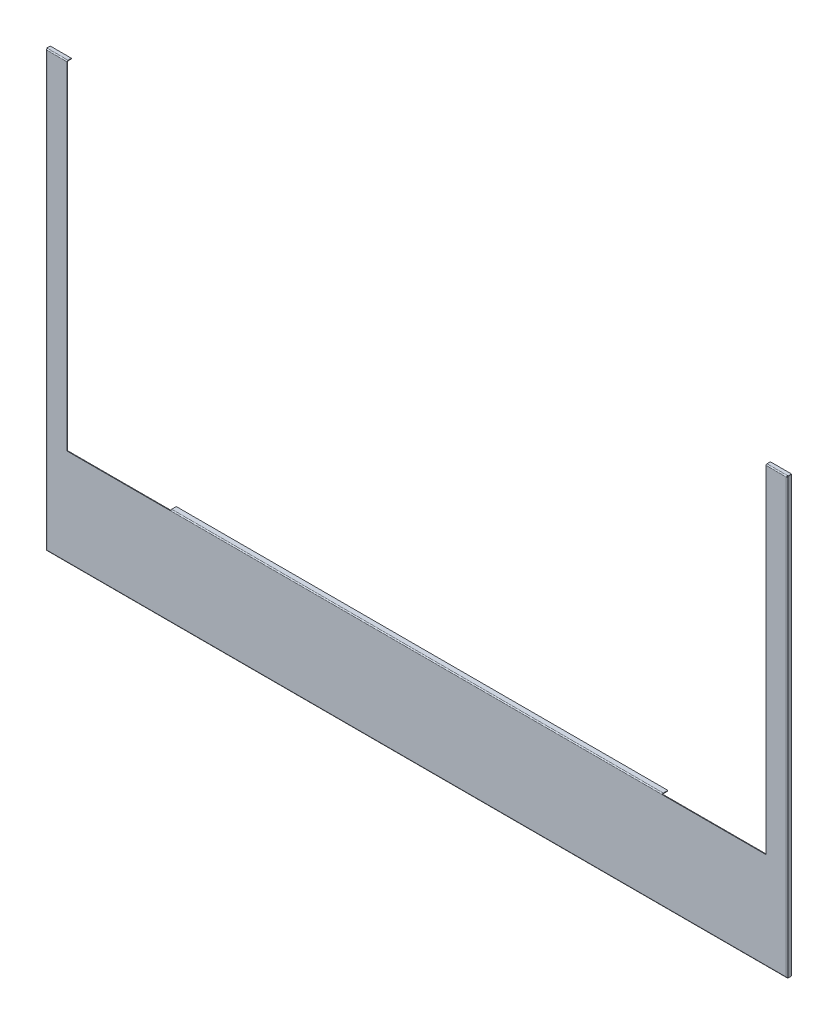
ISO-10303-21;
HEADER;
FILE_DESCRIPTION(('STEP AP214'),'2;1');
FILE_NAME('part.step','',(''),(''),'','','');
FILE_SCHEMA(('AUTOMOTIVE_DESIGN { 1 0 10303 214 1 1 1 1 }'));
ENDSEC;
DATA;
#1=APPLICATION_CONTEXT('core data for automotive mechanical design processes');
#2=APPLICATION_PROTOCOL_DEFINITION('international standard','automotive_design',2000,#1);
#3=PRODUCT_CONTEXT('',#1,'mechanical');
#4=PRODUCT('Part','Part','',(#3));
#5=PRODUCT_RELATED_PRODUCT_CATEGORY('part','',(#4));
#6=PRODUCT_DEFINITION_FORMATION('','',#4);
#7=PRODUCT_DEFINITION_CONTEXT('part definition',#1,'design');
#8=PRODUCT_DEFINITION('design','',#6,#7);
#9=PRODUCT_DEFINITION_SHAPE('','',#8);
#10=(LENGTH_UNIT() NAMED_UNIT(*) SI_UNIT(.MILLI.,.METRE.));
#11=(NAMED_UNIT(*) PLANE_ANGLE_UNIT() SI_UNIT($,.RADIAN.));
#12=(NAMED_UNIT(*) SI_UNIT($,.STERADIAN.) SOLID_ANGLE_UNIT());
#13=UNCERTAINTY_MEASURE_WITH_UNIT(LENGTH_MEASURE(1.E-05),#10,'distance_accuracy_value','');
#14=(GEOMETRIC_REPRESENTATION_CONTEXT(3) GLOBAL_UNCERTAINTY_ASSIGNED_CONTEXT((#13)) GLOBAL_UNIT_ASSIGNED_CONTEXT((#10,
#11,#12)) REPRESENTATION_CONTEXT('',''));
#15=CARTESIAN_POINT('',(0.,0.,0.));
#16=DIRECTION('',(0.,0.,1.));
#17=DIRECTION('',(1.,0.,0.));
#18=AXIS2_PLACEMENT_3D('',#15,#16,#17);
#19=CARTESIAN_POINT('',(-297.5,-96.8,0.));
#20=DIRECTION('',(0.,1.,0.));
#21=DIRECTION('',(1.,0.,0.));
#22=AXIS2_PLACEMENT_3D('',#19,#20,#21);
#23=PLANE('',#22);
#24=DIRECTION('',(1.,0.,0.));
#25=VECTOR('',#24,1.);
#26=CARTESIAN_POINT('',(-297.5,-96.8,0.));
#27=LINE('',#26,#25);
#28=CARTESIAN_POINT('',(197.3,-96.8,0.));
#29=VERTEX_POINT('',#28);
#30=CARTESIAN_POINT('',(280.2,-96.8,0.));
#31=VERTEX_POINT('',#30);
#32=EDGE_CURVE('E404',#29,#31,#27,.T.);
#33=ORIENTED_EDGE('',*,*,#32,.F.);
#34=DIRECTION('',(0.,-1.34280330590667E-12,1.));
#35=VECTOR('',#34,1.);
#36=CARTESIAN_POINT('',(197.3,-96.8000000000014,0.5));
#37=LINE('',#36,#35);
#38=CARTESIAN_POINT('',(197.3,-96.8000000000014,0.5));
#39=VERTEX_POINT('',#38);
#40=EDGE_CURVE('E350',#29,#39,#37,.T.);
#41=ORIENTED_EDGE('',*,*,#40,.T.);
#42=DIRECTION('',(-1.,0.,0.));
#43=VECTOR('',#42,1.);
#44=CARTESIAN_POINT('',(-297.5,-96.8,0.5));
#45=LINE('',#44,#43);
#46=CARTESIAN_POINT('',(280.2,-96.8,0.5));
#47=VERTEX_POINT('',#46);
#48=EDGE_CURVE('E438',#39,#47,#45,.F.);
#49=ORIENTED_EDGE('',*,*,#48,.T.);
#50=DIRECTION('',(0.,0.,-1.));
#51=VECTOR('',#50,1.);
#52=CARTESIAN_POINT('',(280.2,-96.8,0.));
#53=LINE('',#52,#51);
#54=EDGE_CURVE('E451',#47,#31,#53,.T.);
#55=ORIENTED_EDGE('',*,*,#54,.T.);
#56=EDGE_LOOP('',(#33,#41,#49,#55));
#57=FACE_BOUND('',#56,.T.);
#58=ADVANCED_FACE('F17',(#57),#23,.T.);
#59=CARTESIAN_POINT('',(-297.5,174.5,-3.));
#60=DIRECTION('',(0.,0.,-1.));
#61=DIRECTION('',(-1.,0.,0.));
#62=AXIS2_PLACEMENT_3D('',#59,#60,#61);
#63=PLANE('',#62);
#64=DIRECTION('',(1.,0.,0.));
#65=VECTOR('',#64,1.);
#66=CARTESIAN_POINT('',(-297.5,174.5,-3.));
#67=LINE('',#66,#65);
#68=CARTESIAN_POINT('',(-297.5,174.5,-3.));
#69=VERTEX_POINT('',#68);
#70=CARTESIAN_POINT('',(-280.5,174.5,-3.));
#71=VERTEX_POINT('',#70);
#72=EDGE_CURVE('E526',#69,#71,#67,.T.);
#73=ORIENTED_EDGE('',*,*,#72,.T.);
#74=DIRECTION('',(0.,-1.,0.));
#75=VECTOR('',#74,1.);
#76=CARTESIAN_POINT('',(-280.5,174.,-3.));
#77=LINE('',#76,#75);
#78=CARTESIAN_POINT('',(-280.5,174.,-3.));
#79=VERTEX_POINT('',#78);
#80=EDGE_CURVE('E458',#71,#79,#77,.T.);
#81=ORIENTED_EDGE('',*,*,#80,.T.);
#82=DIRECTION('',(1.,0.,0.));
#83=VECTOR('',#82,1.);
#84=CARTESIAN_POINT('',(-297.5,174.,-3.));
#85=LINE('',#84,#83);
#86=CARTESIAN_POINT('',(-297.5,174.,-3.));
#87=VERTEX_POINT('',#86);
#88=EDGE_CURVE('E529',#87,#79,#85,.T.);
#89=ORIENTED_EDGE('',*,*,#88,.F.);
#90=DIRECTION('',(0.,-1.,0.));
#91=VECTOR('',#90,1.);
#92=CARTESIAN_POINT('',(-297.5,174.5,-3.));
#93=LINE('',#92,#91);
#94=EDGE_CURVE('E498',#69,#87,#93,.T.);
#95=ORIENTED_EDGE('',*,*,#94,.F.);
#96=EDGE_LOOP('',(#73,#81,#89,#95));
#97=FACE_BOUND('',#96,.T.);
#98=ADVANCED_FACE('F1325',(#97),#63,.T.);
#99=CARTESIAN_POINT('',(297.5,174.5,0.0652101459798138));
#100=DIRECTION('',(0.,-1.,0.));
#101=DIRECTION('',(0.,0.,-1.));
#102=AXIS2_PLACEMENT_3D('',#99,#100,#101);
#103=PLANE('',#102);
#104=CARTESIAN_POINT('',(280.5,174.5,-3.));
#105=VERTEX_POINT('',#104);
#106=CARTESIAN_POINT('',(297.5,174.5,-2.99999999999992));
#107=VERTEX_POINT('',#106);
#108=EDGE_CURVE('E530',#105,#107,#67,.T.);
#109=ORIENTED_EDGE('',*,*,#108,.F.);
#110=DIRECTION('',(0.,0.,-1.));
#111=VECTOR('',#110,1.);
#112=CARTESIAN_POINT('',(280.5,174.5,0.0652101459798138));
#113=LINE('',#112,#111);
#114=CARTESIAN_POINT('',(280.5,174.5,-0.3));
#115=VERTEX_POINT('',#114);
#116=EDGE_CURVE('E425',#115,#105,#113,.T.);
#117=ORIENTED_EDGE('',*,*,#116,.F.);
#118=DIRECTION('',(1.,0.,0.));
#119=VECTOR('',#118,1.);
#120=CARTESIAN_POINT('',(-297.5,174.5,-0.3));
#121=LINE('',#120,#119);
#122=CARTESIAN_POINT('',(296.998,174.5,-0.3));
#123=VERTEX_POINT('',#122);
#124=EDGE_CURVE('E473',#115,#123,#121,.T.);
#125=ORIENTED_EDGE('',*,*,#124,.T.);
#126=DIRECTION('',(1.,0.,0.));
#127=VECTOR('',#126,1.);
#128=CARTESIAN_POINT('',(-297.5,174.5,-0.3));
#129=LINE('',#128,#127);
#130=CARTESIAN_POINT('',(297.5,174.5,-0.299999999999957));
#131=VERTEX_POINT('',#130);
#132=EDGE_CURVE('E518',#123,#131,#129,.T.);
#133=ORIENTED_EDGE('',*,*,#132,.T.);
#134=DIRECTION('',(0.,0.,1.));
#135=VECTOR('',#134,1.);
#136=CARTESIAN_POINT('',(297.5,174.5,-2.99999999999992));
#137=LINE('',#136,#135);
#138=EDGE_CURVE('E507',#107,#131,#137,.T.);
#139=ORIENTED_EDGE('',*,*,#138,.F.);
#140=EDGE_LOOP('',(#109,#117,#125,#133,#139));
#141=FACE_BOUND('',#140,.T.);
#142=ADVANCED_FACE('F1372',(#141),#103,.F.);
#143=CARTESIAN_POINT('',(297.5,174.,0.0652101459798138));
#144=DIRECTION('',(0.,-1.,0.));
#145=DIRECTION('',(0.,0.,-1.));
#146=AXIS2_PLACEMENT_3D('',#143,#144,#145);
#147=PLANE('',#146);
#148=DIRECTION('',(0.,0.,-1.));
#149=VECTOR('',#148,1.);
#150=CARTESIAN_POINT('',(280.5,174.,0.0652101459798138));
#151=LINE('',#150,#149);
#152=CARTESIAN_POINT('',(280.5,174.,-0.3));
#153=VERTEX_POINT('',#152);
#154=CARTESIAN_POINT('',(280.5,174.,-3.));
#155=VERTEX_POINT('',#154);
#156=EDGE_CURVE('E418',#153,#155,#151,.T.);
#157=ORIENTED_EDGE('',*,*,#156,.T.);
#158=CARTESIAN_POINT('',(297.5,174.,-2.99999999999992));
#159=VERTEX_POINT('',#158);
#160=EDGE_CURVE('E503',#155,#159,#85,.T.);
#161=ORIENTED_EDGE('',*,*,#160,.T.);
#162=DIRECTION('',(0.,0.,1.));
#163=VECTOR('',#162,1.);
#164=CARTESIAN_POINT('',(297.5,174.,-2.99999999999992));
#165=LINE('',#164,#163);
#166=CARTESIAN_POINT('',(297.5,174.,-0.3));
#167=VERTEX_POINT('',#166);
#168=EDGE_CURVE('E504',#159,#167,#165,.T.);
#169=ORIENTED_EDGE('',*,*,#168,.T.);
#170=DIRECTION('',(1.,0.,0.));
#171=VECTOR('',#170,1.);
#172=CARTESIAN_POINT('',(-297.5,174.,-0.3));
#173=LINE('',#172,#171);
#174=CARTESIAN_POINT('',(296.998,174.,-0.3));
#175=VERTEX_POINT('',#174);
#176=EDGE_CURVE('E533',#175,#167,#173,.T.);
#177=ORIENTED_EDGE('',*,*,#176,.F.);
#178=DIRECTION('',(1.,0.,0.));
#179=VECTOR('',#178,1.);
#180=CARTESIAN_POINT('',(-297.5,174.,-0.3));
#181=LINE('',#180,#179);
#182=EDGE_CURVE('E469',#153,#175,#181,.T.);
#183=ORIENTED_EDGE('',*,*,#182,.F.);
#184=EDGE_LOOP('',(#157,#161,#169,#177,#183));
#185=FACE_BOUND('',#184,.T.);
#186=ADVANCED_FACE('F1383',(#185),#147,.T.);
#187=CARTESIAN_POINT('',(296.7,173.7,-0.3));
#188=DIRECTION('',(-1.,0.,0.));
#189=DIRECTION('',(0.,0.,-1.));
#190=AXIS2_PLACEMENT_3D('',#187,#188,#189);
#191=CYLINDRICAL_SURFACE('',#190,0.3);
#192=DIRECTION('',(-1.,0.,0.));
#193=VECTOR('',#192,1.);
#194=CARTESIAN_POINT('',(296.7,173.7,0.));
#195=LINE('',#194,#193);
#196=CARTESIAN_POINT('',(296.7,173.7,0.));
#197=VERTEX_POINT('',#196);
#198=CARTESIAN_POINT('',(280.5,173.7,0.));
#199=VERTEX_POINT('',#198);
#200=EDGE_CURVE('E771',#197,#199,#195,.T.);
#201=ORIENTED_EDGE('',*,*,#200,.T.);
#202=CARTESIAN_POINT('',(280.5,173.7,-0.3));
#203=DIRECTION('',(-1.,0.,0.));
#204=DIRECTION('',(0.,-1.,0.));
#205=AXIS2_PLACEMENT_3D('',#202,#203,#204);
#206=CIRCLE('',#205,0.3);
#207=EDGE_CURVE('E417',#153,#199,#206,.F.);
#208=ORIENTED_EDGE('',*,*,#207,.F.);
#209=ORIENTED_EDGE('',*,*,#182,.T.);
#210=CARTESIAN_POINT('',(296.7,173.7,-0.3));
#211=DIRECTION('',(-0.709467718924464,0.70473793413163,0.));
#212=DIRECTION('',(-0.70473793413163,-0.709467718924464,0.));
#213=AXIS2_PLACEMENT_3D('',#210,#211,#212);
#214=ELLIPSE('',#213,0.422852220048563,0.3);
#215=EDGE_CURVE('E470',#175,#197,#214,.F.);
#216=ORIENTED_EDGE('',*,*,#215,.T.);
#217=EDGE_LOOP('',(#201,#208,#209,#216));
#218=FACE_BOUND('',#217,.T.);
#219=ADVANCED_FACE('F1417',(#218),#191,.F.);
#220=CARTESIAN_POINT('',(296.7,173.7,-0.3));
#221=DIRECTION('',(-1.,0.,0.));
#222=DIRECTION('',(0.,0.,-1.));
#223=AXIS2_PLACEMENT_3D('',#220,#221,#222);
#224=CYLINDRICAL_SURFACE('',#223,0.8);
#225=CARTESIAN_POINT('',(280.5,173.7,-0.3));
#226=DIRECTION('',(-1.,0.,0.));
#227=DIRECTION('',(0.,0.,1.));
#228=AXIS2_PLACEMENT_3D('',#225,#226,#227);
#229=CIRCLE('',#228,0.8);
#230=CARTESIAN_POINT('',(280.5,173.7,0.5));
#231=VERTEX_POINT('',#230);
#232=EDGE_CURVE('E396',#115,#231,#229,.F.);
#233=ORIENTED_EDGE('',*,*,#232,.T.);
#234=DIRECTION('',(-1.,0.,0.));
#235=VECTOR('',#234,1.);
#236=CARTESIAN_POINT('',(296.7,173.7,0.5));
#237=LINE('',#236,#235);
#238=CARTESIAN_POINT('',(296.7,173.7,0.5));
#239=VERTEX_POINT('',#238);
#240=EDGE_CURVE('E766',#239,#231,#237,.T.);
#241=ORIENTED_EDGE('',*,*,#240,.F.);
#242=CARTESIAN_POINT('',(296.7,173.7,-0.3));
#243=DIRECTION('',(-0.709467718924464,0.70473793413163,0.));
#244=DIRECTION('',(-0.70473793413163,-0.709467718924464,0.));
#245=AXIS2_PLACEMENT_3D('',#242,#243,#244);
#246=ELLIPSE('',#245,1.1276059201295,0.8);
#247=CARTESIAN_POINT('',(296.998,174.,0.441619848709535));
#248=VERTEX_POINT('',#247);
#249=EDGE_CURVE('E478',#248,#239,#246,.F.);
#250=ORIENTED_EDGE('',*,*,#249,.F.);
#251=CARTESIAN_POINT('',(296.998,173.7,-0.3));
#252=DIRECTION('',(-1.,0.,0.));
#253=DIRECTION('',(0.,0.,1.));
#254=AXIS2_PLACEMENT_3D('',#251,#252,#253);
#255=CIRCLE('',#254,0.8);
#256=EDGE_CURVE('E479',#123,#248,#255,.F.);
#257=ORIENTED_EDGE('',*,*,#256,.F.);
#258=ORIENTED_EDGE('',*,*,#124,.F.);
#259=EDGE_LOOP('',(#233,#241,#250,#257,#258));
#260=FACE_BOUND('',#259,.T.);
#261=ADVANCED_FACE('F1431',(#260),#224,.T.);
#262=CARTESIAN_POINT('',(-297.5,-174.5,0.5));
#263=DIRECTION('',(0.,0.,-1.));
#264=DIRECTION('',(-1.,0.,0.));
#265=AXIS2_PLACEMENT_3D('',#262,#263,#264);
#266=PLANE('',#265);
#267=ORIENTED_EDGE('',*,*,#240,.T.);
#268=DIRECTION('',(0.,1.,0.));
#269=VECTOR('',#268,1.);
#270=CARTESIAN_POINT('',(280.5,-174.5,0.5));
#271=LINE('',#270,#269);
#272=CARTESIAN_POINT('',(280.5,-96.5,0.5));
#273=VERTEX_POINT('',#272);
#274=EDGE_CURVE('E429',#273,#231,#271,.T.);
#275=ORIENTED_EDGE('',*,*,#274,.F.);
#276=CARTESIAN_POINT('',(280.2,-96.5,0.5));
#277=DIRECTION('',(0.,0.,-1.));
#278=DIRECTION('',(-1.,0.,0.));
#279=AXIS2_PLACEMENT_3D('',#276,#277,#278);
#280=CIRCLE('',#279,0.300000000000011);
#281=EDGE_CURVE('E439',#47,#273,#280,.F.);
#282=ORIENTED_EDGE('',*,*,#281,.F.);
#283=ORIENTED_EDGE('',*,*,#48,.F.);
#284=DIRECTION('',(-1.,0.,0.));
#285=VECTOR('',#284,1.);
#286=CARTESIAN_POINT('',(197.3,-96.8000000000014,0.5));
#287=LINE('',#286,#285);
#288=CARTESIAN_POINT('',(-197.3,-96.8000000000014,0.5));
#289=VERTEX_POINT('',#288);
#290=EDGE_CURVE('E339',#39,#289,#287,.T.);
#291=ORIENTED_EDGE('',*,*,#290,.T.);
#292=CARTESIAN_POINT('',(-280.2,-96.8,0.5));
#293=VERTEX_POINT('',#292);
#294=EDGE_CURVE('E434',#293,#289,#45,.F.);
#295=ORIENTED_EDGE('',*,*,#294,.F.);
#296=CARTESIAN_POINT('',(-280.2,-96.5,0.5));
#297=DIRECTION('',(0.,0.,-1.));
#298=DIRECTION('',(-1.,0.,0.));
#299=AXIS2_PLACEMENT_3D('',#296,#297,#298);
#300=CIRCLE('',#299,0.300000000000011);
#301=CARTESIAN_POINT('',(-280.5,-96.5,0.5));
#302=VERTEX_POINT('',#301);
#303=EDGE_CURVE('E430',#302,#293,#300,.F.);
#304=ORIENTED_EDGE('',*,*,#303,.F.);
#305=DIRECTION('',(0.,1.,0.));
#306=VECTOR('',#305,1.);
#307=CARTESIAN_POINT('',(-280.5,-174.5,0.5));
#308=LINE('',#307,#306);
#309=CARTESIAN_POINT('',(-280.5,173.7,0.5));
#310=VERTEX_POINT('',#309);
#311=EDGE_CURVE('E384',#310,#302,#308,.F.);
#312=ORIENTED_EDGE('',*,*,#311,.F.);
#313=CARTESIAN_POINT('',(-296.7,173.7,0.5));
#314=VERTEX_POINT('',#313);
#315=EDGE_CURVE('E765',#310,#314,#237,.T.);
#316=ORIENTED_EDGE('',*,*,#315,.T.);
#317=DIRECTION('',(0.,-1.,0.));
#318=VECTOR('',#317,1.);
#319=CARTESIAN_POINT('',(-296.7,174.5,0.5));
#320=LINE('',#319,#318);
#321=CARTESIAN_POINT('',(-296.7,-173.7,0.5));
#322=VERTEX_POINT('',#321);
#323=EDGE_CURVE('E749',#314,#322,#320,.T.);
#324=ORIENTED_EDGE('',*,*,#323,.T.);
#325=DIRECTION('',(1.,0.,0.));
#326=VECTOR('',#325,1.);
#327=CARTESIAN_POINT('',(-297.5,-173.7,0.5));
#328=LINE('',#327,#326);
#329=CARTESIAN_POINT('',(296.7,-173.7,0.5));
#330=VERTEX_POINT('',#329);
#331=EDGE_CURVE('E731',#322,#330,#328,.T.);
#332=ORIENTED_EDGE('',*,*,#331,.T.);
#333=DIRECTION('',(0.,1.,0.));
#334=VECTOR('',#333,1.);
#335=CARTESIAN_POINT('',(296.7,-173.7,0.5));
#336=LINE('',#335,#334);
#337=EDGE_CURVE('E757',#330,#239,#336,.T.);
#338=ORIENTED_EDGE('',*,*,#337,.T.);
#339=EDGE_LOOP('',(#267,#275,#282,#283,#291,#295,#304,#312,#316,#324,#332,#338));
#340=FACE_BOUND('',#339,.T.);
#341=ADVANCED_FACE('F1652',(#340),#266,.F.);
#342=CARTESIAN_POINT('',(-297.5,-174.5,0.));
#343=DIRECTION('',(0.,0.,-1.));
#344=DIRECTION('',(-1.,0.,0.));
#345=AXIS2_PLACEMENT_3D('',#342,#343,#344);
#346=PLANE('',#345);
#347=DIRECTION('',(0.,1.,0.));
#348=VECTOR('',#347,1.);
#349=CARTESIAN_POINT('',(280.5,-174.5,0.));
#350=LINE('',#349,#348);
#351=CARTESIAN_POINT('',(280.5,-96.5,0.));
#352=VERTEX_POINT('',#351);
#353=EDGE_CURVE('E395',#352,#199,#350,.T.);
#354=ORIENTED_EDGE('',*,*,#353,.T.);
#355=ORIENTED_EDGE('',*,*,#200,.F.);
#356=DIRECTION('',(0.,1.,0.));
#357=VECTOR('',#356,1.);
#358=CARTESIAN_POINT('',(296.7,-173.7,0.));
#359=LINE('',#358,#357);
#360=CARTESIAN_POINT('',(296.7,-173.7,0.));
#361=VERTEX_POINT('',#360);
#362=EDGE_CURVE('E761',#361,#197,#359,.T.);
#363=ORIENTED_EDGE('',*,*,#362,.F.);
#364=DIRECTION('',(1.,0.,0.));
#365=VECTOR('',#364,1.);
#366=CARTESIAN_POINT('',(-297.5,-173.7,0.));
#367=LINE('',#366,#365);
#368=CARTESIAN_POINT('',(-296.7,-173.7,0.));
#369=VERTEX_POINT('',#368);
#370=EDGE_CURVE('E745',#369,#361,#367,.T.);
#371=ORIENTED_EDGE('',*,*,#370,.F.);
#372=DIRECTION('',(0.,-1.,0.));
#373=VECTOR('',#372,1.);
#374=CARTESIAN_POINT('',(-296.7,174.5,0.));
#375=LINE('',#374,#373);
#376=CARTESIAN_POINT('',(-296.7,173.7,0.));
#377=VERTEX_POINT('',#376);
#378=EDGE_CURVE('E753',#377,#369,#375,.T.);
#379=ORIENTED_EDGE('',*,*,#378,.F.);
#380=CARTESIAN_POINT('',(-280.5,173.7,0.));
#381=VERTEX_POINT('',#380);
#382=EDGE_CURVE('E770',#381,#377,#195,.T.);
#383=ORIENTED_EDGE('',*,*,#382,.F.);
#384=DIRECTION('',(0.,-1.,0.));
#385=VECTOR('',#384,1.);
#386=CARTESIAN_POINT('',(-280.5,-174.5,0.));
#387=LINE('',#386,#385);
#388=CARTESIAN_POINT('',(-280.5,-96.5,0.));
#389=VERTEX_POINT('',#388);
#390=EDGE_CURVE('E391',#381,#389,#387,.T.);
#391=ORIENTED_EDGE('',*,*,#390,.T.);
#392=CARTESIAN_POINT('',(-280.2,-96.5,0.));
#393=DIRECTION('',(0.,0.,-1.));
#394=DIRECTION('',(-1.,0.,0.));
#395=AXIS2_PLACEMENT_3D('',#392,#393,#394);
#396=CIRCLE('',#395,0.300000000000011);
#397=CARTESIAN_POINT('',(-280.2,-96.8,0.));
#398=VERTEX_POINT('',#397);
#399=EDGE_CURVE('E409',#389,#398,#396,.F.);
#400=ORIENTED_EDGE('',*,*,#399,.T.);
#401=CARTESIAN_POINT('',(-197.3,-96.8,0.));
#402=VERTEX_POINT('',#401);
#403=EDGE_CURVE('E405',#398,#402,#27,.T.);
#404=ORIENTED_EDGE('',*,*,#403,.T.);
#405=DIRECTION('',(1.,0.,0.));
#406=VECTOR('',#405,1.);
#407=CARTESIAN_POINT('',(-280.2,-96.8,0.));
#408=LINE('',#407,#406);
#409=EDGE_CURVE('E346',#29,#402,#408,.F.);
#410=ORIENTED_EDGE('',*,*,#409,.F.);
#411=ORIENTED_EDGE('',*,*,#32,.T.);
#412=CARTESIAN_POINT('',(280.2,-96.5,0.));
#413=DIRECTION('',(0.,0.,-1.));
#414=DIRECTION('',(-1.,0.,0.));
#415=AXIS2_PLACEMENT_3D('',#412,#413,#414);
#416=CIRCLE('',#415,0.300000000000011);
#417=EDGE_CURVE('E400',#31,#352,#416,.F.);
#418=ORIENTED_EDGE('',*,*,#417,.T.);
#419=EDGE_LOOP('',(#354,#355,#363,#371,#379,#383,#391,#400,#404,#410,#411,#418));
#420=FACE_BOUND('',#419,.T.);
#421=ADVANCED_FACE('F19',(#420),#346,.T.);
#422=CARTESIAN_POINT('',(296.998,174.5,0.5));
#423=DIRECTION('',(1.,0.,0.));
#424=DIRECTION('',(0.,0.,-1.));
#425=AXIS2_PLACEMENT_3D('',#422,#423,#424);
#426=PLANE('',#425);
#427=DIRECTION('',(0.,0.,1.));
#428=VECTOR('',#427,1.);
#429=CARTESIAN_POINT('',(296.998,-174.,-2.99999999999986));
#430=LINE('',#429,#428);
#431=CARTESIAN_POINT('',(296.998,-174.,-2.99999999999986));
#432=VERTEX_POINT('',#431);
#433=CARTESIAN_POINT('',(296.998,-174.,-0.299999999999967));
#434=VERTEX_POINT('',#433);
#435=EDGE_CURVE('E734',#432,#434,#430,.T.);
#436=ORIENTED_EDGE('',*,*,#435,.T.);
#437=DIRECTION('',(0.,0.,-1.));
#438=VECTOR('',#437,1.);
#439=CARTESIAN_POINT('',(296.998,-174.,-999.5));
#440=LINE('',#439,#438);
#441=CARTESIAN_POINT('',(296.998,-174.,0.441619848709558));
#442=VERTEX_POINT('',#441);
#443=EDGE_CURVE('E652',#442,#434,#440,.T.);
#444=ORIENTED_EDGE('',*,*,#443,.F.);
#445=CARTESIAN_POINT('',(296.998,-173.7,-0.3));
#446=DIRECTION('',(1.,0.,0.));
#447=DIRECTION('',(0.,0.,-1.));
#448=AXIS2_PLACEMENT_3D('',#445,#446,#447);
#449=CIRCLE('',#448,0.8);
#450=CARTESIAN_POINT('',(296.998,-174.5,-0.3));
#451=VERTEX_POINT('',#450);
#452=EDGE_CURVE('E686',#451,#442,#449,.F.);
#453=ORIENTED_EDGE('',*,*,#452,.F.);
#454=DIRECTION('',(0.,0.,1.));
#455=VECTOR('',#454,1.);
#456=CARTESIAN_POINT('',(296.998,-174.5,-2.99999999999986));
#457=LINE('',#456,#455);
#458=CARTESIAN_POINT('',(296.998,-174.5,-2.99999999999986));
#459=VERTEX_POINT('',#458);
#460=EDGE_CURVE('E718',#459,#451,#457,.T.);
#461=ORIENTED_EDGE('',*,*,#460,.F.);
#462=DIRECTION('',(0.,1.,0.));
#463=VECTOR('',#462,1.);
#464=CARTESIAN_POINT('',(296.998,-174.5,-2.99999999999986));
#465=LINE('',#464,#463);
#466=EDGE_CURVE('E714',#459,#432,#465,.T.);
#467=ORIENTED_EDGE('',*,*,#466,.T.);
#468=EDGE_LOOP('',(#436,#444,#453,#461,#467));
#469=FACE_BOUND('',#468,.T.);
#470=ADVANCED_FACE('F1042',(#469),#426,.T.);
#471=CARTESIAN_POINT('',(-297.5,-174.5,-3.));
#472=DIRECTION('',(0.,0.,1.));
#473=DIRECTION('',(1.,0.,0.));
#474=AXIS2_PLACEMENT_3D('',#471,#472,#473);
#475=PLANE('',#474);
#476=DIRECTION('',(1.,0.,0.));
#477=VECTOR('',#476,1.);
#478=CARTESIAN_POINT('',(-297.5,-174.,-3.));
#479=LINE('',#478,#477);
#480=CARTESIAN_POINT('',(-296.998,-174.,-3.));
#481=VERTEX_POINT('',#480);
#482=EDGE_CURVE('E722',#481,#432,#479,.T.);
#483=ORIENTED_EDGE('',*,*,#482,.T.);
#484=ORIENTED_EDGE('',*,*,#466,.F.);
#485=DIRECTION('',(1.,0.,0.));
#486=VECTOR('',#485,1.);
#487=CARTESIAN_POINT('',(-297.5,-174.5,-3.));
#488=LINE('',#487,#486);
#489=CARTESIAN_POINT('',(-296.998,-174.5,-3.));
#490=VERTEX_POINT('',#489);
#491=EDGE_CURVE('E725',#490,#459,#488,.T.);
#492=ORIENTED_EDGE('',*,*,#491,.F.);
#493=DIRECTION('',(0.,1.,0.));
#494=VECTOR('',#493,1.);
#495=CARTESIAN_POINT('',(-296.998,-174.5,-3.));
#496=LINE('',#495,#494);
#497=EDGE_CURVE('E719',#490,#481,#496,.T.);
#498=ORIENTED_EDGE('',*,*,#497,.T.);
#499=EDGE_LOOP('',(#483,#484,#492,#498));
#500=FACE_BOUND('',#499,.T.);
#501=ADVANCED_FACE('F1034',(#500),#475,.F.);
#502=CARTESIAN_POINT('',(-296.998,-174.5,0.5));
#503=DIRECTION('',(-1.,0.,0.));
#504=DIRECTION('',(0.,0.,1.));
#505=AXIS2_PLACEMENT_3D('',#502,#503,#504);
#506=PLANE('',#505);
#507=DIRECTION('',(0.,0.,-1.));
#508=VECTOR('',#507,1.);
#509=CARTESIAN_POINT('',(-296.998,-174.5,0.0652101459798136));
#510=LINE('',#509,#508);
#511=CARTESIAN_POINT('',(-296.998,-174.5,-0.3));
#512=VERTEX_POINT('',#511);
#513=EDGE_CURVE('E723',#512,#490,#510,.T.);
#514=ORIENTED_EDGE('',*,*,#513,.F.);
#515=CARTESIAN_POINT('',(-296.998,-173.7,-0.3));
#516=DIRECTION('',(1.,0.,0.));
#517=DIRECTION('',(0.,0.,-1.));
#518=AXIS2_PLACEMENT_3D('',#515,#516,#517);
#519=CIRCLE('',#518,0.8);
#520=CARTESIAN_POINT('',(-296.998,-174.,0.441619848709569));
#521=VERTEX_POINT('',#520);
#522=EDGE_CURVE('E700',#512,#521,#519,.F.);
#523=ORIENTED_EDGE('',*,*,#522,.T.);
#524=DIRECTION('',(0.,0.,-1.));
#525=VECTOR('',#524,1.);
#526=CARTESIAN_POINT('',(-296.998,-174.,-999.5));
#527=LINE('',#526,#525);
#528=CARTESIAN_POINT('',(-296.998,-174.,-0.3));
#529=VERTEX_POINT('',#528);
#530=EDGE_CURVE('E704',#521,#529,#527,.T.);
#531=ORIENTED_EDGE('',*,*,#530,.T.);
#532=DIRECTION('',(0.,0.,-1.));
#533=VECTOR('',#532,1.);
#534=CARTESIAN_POINT('',(-296.998,-174.,0.0652101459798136));
#535=LINE('',#534,#533);
#536=EDGE_CURVE('E715',#529,#481,#535,.T.);
#537=ORIENTED_EDGE('',*,*,#536,.T.);
#538=ORIENTED_EDGE('',*,*,#497,.F.);
#539=EDGE_LOOP('',(#514,#523,#531,#537,#538));
#540=FACE_BOUND('',#539,.T.);
#541=ADVANCED_FACE('F1028',(#540),#506,.T.);
#542=CARTESIAN_POINT('',(297.5,-174.,0.0652101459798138));
#543=DIRECTION('',(0.,-1.,0.));
#544=DIRECTION('',(0.,0.,-1.));
#545=AXIS2_PLACEMENT_3D('',#542,#543,#544);
#546=PLANE('',#545);
#547=DIRECTION('',(-1.,0.,0.));
#548=VECTOR('',#547,1.);
#549=CARTESIAN_POINT('',(297.5,-174.,-0.3));
#550=LINE('',#549,#548);
#551=EDGE_CURVE('E711',#434,#529,#550,.T.);
#552=ORIENTED_EDGE('',*,*,#551,.F.);
#553=ORIENTED_EDGE('',*,*,#435,.F.);
#554=ORIENTED_EDGE('',*,*,#482,.F.);
#555=ORIENTED_EDGE('',*,*,#536,.F.);
#556=EDGE_LOOP('',(#552,#553,#554,#555));
#557=FACE_BOUND('',#556,.T.);
#558=ADVANCED_FACE('F1033',(#557),#546,.F.);
#559=CARTESIAN_POINT('',(297.5,-174.5,0.0652101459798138));
#560=DIRECTION('',(0.,-1.,0.));
#561=DIRECTION('',(0.,0.,-1.));
#562=AXIS2_PLACEMENT_3D('',#559,#560,#561);
#563=PLANE('',#562);
#564=ORIENTED_EDGE('',*,*,#460,.T.);
#565=DIRECTION('',(-1.,0.,0.));
#566=VECTOR('',#565,1.);
#567=CARTESIAN_POINT('',(297.5,-174.5,-0.3));
#568=LINE('',#567,#566);
#569=EDGE_CURVE('E726',#451,#512,#568,.T.);
#570=ORIENTED_EDGE('',*,*,#569,.T.);
#571=ORIENTED_EDGE('',*,*,#513,.T.);
#572=ORIENTED_EDGE('',*,*,#491,.T.);
#573=EDGE_LOOP('',(#564,#570,#571,#572));
#574=FACE_BOUND('',#573,.T.);
#575=ADVANCED_FACE('F1103',(#574),#563,.T.);
#576=CARTESIAN_POINT('',(-297.5,-173.7,-0.3));
#577=DIRECTION('',(1.,0.,0.));
#578=DIRECTION('',(0.,0.,-1.));
#579=AXIS2_PLACEMENT_3D('',#576,#577,#578);
#580=CYLINDRICAL_SURFACE('',#579,0.3);
#581=CARTESIAN_POINT('',(296.7,-173.7,-0.3));
#582=DIRECTION('',(0.709467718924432,0.704737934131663,0.));
#583=DIRECTION('',(0.704737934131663,-0.709467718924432,0.));
#584=AXIS2_PLACEMENT_3D('',#581,#582,#583);
#585=ELLIPSE('',#584,0.422852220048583,0.3);
#586=EDGE_CURVE('E689',#434,#361,#585,.F.);
#587=ORIENTED_EDGE('',*,*,#586,.F.);
#588=ORIENTED_EDGE('',*,*,#551,.T.);
#589=CARTESIAN_POINT('',(-296.7,-173.7,-0.3));
#590=DIRECTION('',(0.709467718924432,-0.704737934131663,0.));
#591=DIRECTION('',(0.704737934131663,0.709467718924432,0.));
#592=AXIS2_PLACEMENT_3D('',#589,#590,#591);
#593=ELLIPSE('',#592,0.422852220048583,0.3);
#594=EDGE_CURVE('E693',#529,#369,#593,.F.);
#595=ORIENTED_EDGE('',*,*,#594,.T.);
#596=ORIENTED_EDGE('',*,*,#370,.T.);
#597=EDGE_LOOP('',(#587,#588,#595,#596));
#598=FACE_BOUND('',#597,.T.);
#599=ADVANCED_FACE('F1115',(#598),#580,.F.);
#600=CARTESIAN_POINT('',(-297.5,-173.7,-0.3));
#601=DIRECTION('',(1.,0.,0.));
#602=DIRECTION('',(0.,0.,-1.));
#603=AXIS2_PLACEMENT_3D('',#600,#601,#602);
#604=CYLINDRICAL_SURFACE('',#603,0.8);
#605=ORIENTED_EDGE('',*,*,#452,.T.);
#606=CARTESIAN_POINT('',(296.7,-173.7,-0.3));
#607=DIRECTION('',(0.709467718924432,0.704737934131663,0.));
#608=DIRECTION('',(0.704737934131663,-0.709467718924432,0.));
#609=AXIS2_PLACEMENT_3D('',#606,#607,#608);
#610=ELLIPSE('',#609,1.12760592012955,0.8);
#611=EDGE_CURVE('E707',#442,#330,#610,.F.);
#612=ORIENTED_EDGE('',*,*,#611,.T.);
#613=ORIENTED_EDGE('',*,*,#331,.F.);
#614=CARTESIAN_POINT('',(-296.7,-173.7,-0.3));
#615=DIRECTION('',(0.709467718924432,-0.704737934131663,0.));
#616=DIRECTION('',(0.704737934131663,0.709467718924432,0.));
#617=AXIS2_PLACEMENT_3D('',#614,#615,#616);
#618=ELLIPSE('',#617,1.12760592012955,0.8);
#619=EDGE_CURVE('E696',#521,#322,#618,.F.);
#620=ORIENTED_EDGE('',*,*,#619,.F.);
#621=ORIENTED_EDGE('',*,*,#522,.F.);
#622=ORIENTED_EDGE('',*,*,#569,.F.);
#623=EDGE_LOOP('',(#605,#612,#613,#620,#621,#622));
#624=FACE_BOUND('',#623,.T.);
#625=ADVANCED_FACE('F1021',(#624),#604,.T.);
#626=CARTESIAN_POINT('',(408.037934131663,535.767718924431,1000.5));
#627=DIRECTION('',(0.709467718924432,-0.704737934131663,0.));
#628=DIRECTION('',(0.704737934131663,0.709467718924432,0.));
#629=AXIS2_PLACEMENT_3D('',#626,#627,#628);
#630=PLANE('',#629);
#631=ORIENTED_EDGE('',*,*,#530,.F.);
#632=ORIENTED_EDGE('',*,*,#619,.T.);
#633=DIRECTION('',(0.,0.,1.));
#634=VECTOR('',#633,1.);
#635=CARTESIAN_POINT('',(-296.7,-173.7,0.));
#636=LINE('',#635,#634);
#637=EDGE_CURVE('E775',#369,#322,#636,.T.);
#638=ORIENTED_EDGE('',*,*,#637,.F.);
#639=ORIENTED_EDGE('',*,*,#594,.F.);
#640=EDGE_LOOP('',(#631,#632,#638,#639));
#641=FACE_BOUND('',#640,.T.);
#642=ADVANCED_FACE('F1010',(#641),#630,.F.);
#643=CARTESIAN_POINT('',(-408.037934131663,535.767718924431,1000.5));
#644=DIRECTION('',(0.709467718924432,0.704737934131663,0.));
#645=DIRECTION('',(-0.704737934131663,0.709467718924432,0.));
#646=AXIS2_PLACEMENT_3D('',#643,#644,#645);
#647=PLANE('',#646);
#648=ORIENTED_EDGE('',*,*,#443,.T.);
#649=ORIENTED_EDGE('',*,*,#586,.T.);
#650=DIRECTION('',(0.,0.,1.));
#651=VECTOR('',#650,1.);
#652=CARTESIAN_POINT('',(296.7,-173.7,0.));
#653=LINE('',#652,#651);
#654=EDGE_CURVE('E778',#361,#330,#653,.T.);
#655=ORIENTED_EDGE('',*,*,#654,.T.);
#656=ORIENTED_EDGE('',*,*,#611,.F.);
#657=EDGE_LOOP('',(#648,#649,#655,#656));
#658=FACE_BOUND('',#657,.T.);
#659=ADVANCED_FACE('F1004',(#658),#647,.T.);
#660=CARTESIAN_POINT('',(297.5,174.5,-0.3));
#661=DIRECTION('',(0.,0.,-1.));
#662=DIRECTION('',(0.,1.,0.));
#663=AXIS2_PLACEMENT_3D('',#660,#661,#662);
#664=PLANE('',#663);
#665=DIRECTION('',(1.,0.,0.));
#666=VECTOR('',#665,1.);
#667=CARTESIAN_POINT('',(297.5,-173.998,-0.3));
#668=LINE('',#667,#666);
#669=CARTESIAN_POINT('',(297.,-173.998,-0.3));
#670=VERTEX_POINT('',#669);
#671=CARTESIAN_POINT('',(297.5,-173.998,-0.3));
#672=VERTEX_POINT('',#671);
#673=EDGE_CURVE('E638',#670,#672,#668,.T.);
#674=ORIENTED_EDGE('',*,*,#673,.F.);
#675=DIRECTION('',(0.,-1.,0.));
#676=VECTOR('',#675,1.);
#677=CARTESIAN_POINT('',(297.,174.5,-0.3));
#678=LINE('',#677,#676);
#679=CARTESIAN_POINT('',(297.,-174.5,-0.3));
#680=VERTEX_POINT('',#679);
#681=EDGE_CURVE('E641',#670,#680,#678,.T.);
#682=ORIENTED_EDGE('',*,*,#681,.T.);
#683=DIRECTION('',(1.,0.,0.));
#684=VECTOR('',#683,1.);
#685=CARTESIAN_POINT('',(297.,-174.5,-0.3));
#686=LINE('',#685,#684);
#687=CARTESIAN_POINT('',(297.5,-174.5,-0.299999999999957));
#688=VERTEX_POINT('',#687);
#689=EDGE_CURVE('E667',#680,#688,#686,.T.);
#690=ORIENTED_EDGE('',*,*,#689,.T.);
#691=DIRECTION('',(0.,-1.,0.));
#692=VECTOR('',#691,1.);
#693=CARTESIAN_POINT('',(297.5,174.5,-0.3));
#694=LINE('',#693,#692);
#695=EDGE_CURVE('E666',#672,#688,#694,.T.);
#696=ORIENTED_EDGE('',*,*,#695,.F.);
#697=EDGE_LOOP('',(#674,#682,#690,#696));
#698=FACE_BOUND('',#697,.T.);
#699=ADVANCED_FACE('F1009',(#698),#664,.F.);
#700=CARTESIAN_POINT('',(297.5,-174.5,-2.99999999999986));
#701=DIRECTION('',(0.,0.,1.));
#702=DIRECTION('',(1.,0.,0.));
#703=AXIS2_PLACEMENT_3D('',#700,#701,#702);
#704=PLANE('',#703);
#705=DIRECTION('',(0.,1.,0.));
#706=VECTOR('',#705,1.);
#707=CARTESIAN_POINT('',(297.,-174.5,-2.99999999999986));
#708=LINE('',#707,#706);
#709=CARTESIAN_POINT('',(297.,-174.5,-2.99999999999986));
#710=VERTEX_POINT('',#709);
#711=CARTESIAN_POINT('',(297.,173.998,-2.99999999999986));
#712=VERTEX_POINT('',#711);
#713=EDGE_CURVE('E654',#710,#712,#708,.T.);
#714=ORIENTED_EDGE('',*,*,#713,.T.);
#715=DIRECTION('',(-1.,0.,0.));
#716=VECTOR('',#715,1.);
#717=CARTESIAN_POINT('',(297.5,173.998,-2.99999999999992));
#718=LINE('',#717,#716);
#719=CARTESIAN_POINT('',(297.5,173.998,-2.99999999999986));
#720=VERTEX_POINT('',#719);
#721=EDGE_CURVE('E674',#720,#712,#718,.T.);
#722=ORIENTED_EDGE('',*,*,#721,.F.);
#723=DIRECTION('',(0.,1.,0.));
#724=VECTOR('',#723,1.);
#725=CARTESIAN_POINT('',(297.5,-174.5,-2.99999999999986));
#726=LINE('',#725,#724);
#727=CARTESIAN_POINT('',(297.5,-174.5,-2.99999999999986));
#728=VERTEX_POINT('',#727);
#729=EDGE_CURVE('E650',#728,#720,#726,.T.);
#730=ORIENTED_EDGE('',*,*,#729,.F.);
#731=DIRECTION('',(-1.,0.,0.));
#732=VECTOR('',#731,1.);
#733=CARTESIAN_POINT('',(297.5,-174.5,-2.99999999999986));
#734=LINE('',#733,#732);
#735=EDGE_CURVE('E657',#728,#710,#734,.T.);
#736=ORIENTED_EDGE('',*,*,#735,.T.);
#737=EDGE_LOOP('',(#714,#722,#730,#736));
#738=FACE_BOUND('',#737,.T.);
#739=ADVANCED_FACE('F964',(#738),#704,.F.);
#740=CARTESIAN_POINT('',(297.5,173.998,-2.99999999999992));
#741=DIRECTION('',(0.,-1.,0.));
#742=DIRECTION('',(0.,0.,-1.));
#743=AXIS2_PLACEMENT_3D('',#740,#741,#742);
#744=PLANE('',#743);
#745=DIRECTION('',(0.,0.,1.));
#746=VECTOR('',#745,1.);
#747=CARTESIAN_POINT('',(297.,173.998,-2.99999999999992));
#748=LINE('',#747,#746);
#749=CARTESIAN_POINT('',(297.,173.998,-0.3));
#750=VERTEX_POINT('',#749);
#751=EDGE_CURVE('E661',#712,#750,#748,.T.);
#752=ORIENTED_EDGE('',*,*,#751,.T.);
#753=DIRECTION('',(0.,0.,-1.));
#754=VECTOR('',#753,1.);
#755=CARTESIAN_POINT('',(297.,173.998,-999.5));
#756=LINE('',#755,#754);
#757=CARTESIAN_POINT('',(297.,173.998,0.441619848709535));
#758=VERTEX_POINT('',#757);
#759=EDGE_CURVE('E609',#758,#750,#756,.T.);
#760=ORIENTED_EDGE('',*,*,#759,.F.);
#761=CARTESIAN_POINT('',(296.7,173.998,-0.3));
#762=DIRECTION('',(0.,1.,0.));
#763=DIRECTION('',(0.,0.,1.));
#764=AXIS2_PLACEMENT_3D('',#761,#762,#763);
#765=CIRCLE('',#764,0.8);
#766=CARTESIAN_POINT('',(297.5,173.998,-0.3));
#767=VERTEX_POINT('',#766);
#768=EDGE_CURVE('E620',#767,#758,#765,.F.);
#769=ORIENTED_EDGE('',*,*,#768,.F.);
#770=DIRECTION('',(0.,0.,1.));
#771=VECTOR('',#770,1.);
#772=CARTESIAN_POINT('',(297.5,173.998,-2.99999999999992));
#773=LINE('',#772,#771);
#774=EDGE_CURVE('E670',#720,#767,#773,.T.);
#775=ORIENTED_EDGE('',*,*,#774,.F.);
#776=ORIENTED_EDGE('',*,*,#721,.T.);
#777=EDGE_LOOP('',(#752,#760,#769,#775,#776));
#778=FACE_BOUND('',#777,.T.);
#779=ADVANCED_FACE('F958',(#778),#744,.F.);
#780=CARTESIAN_POINT('',(297.5,-174.5,0.0652101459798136));
#781=DIRECTION('',(0.,1.,0.));
#782=DIRECTION('',(0.,0.,1.));
#783=AXIS2_PLACEMENT_3D('',#780,#781,#782);
#784=PLANE('',#783);
#785=ORIENTED_EDGE('',*,*,#689,.F.);
#786=DIRECTION('',(0.,0.,-1.));
#787=VECTOR('',#786,1.);
#788=CARTESIAN_POINT('',(297.,-174.5,0.0652101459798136));
#789=LINE('',#788,#787);
#790=EDGE_CURVE('E671',#680,#710,#789,.T.);
#791=ORIENTED_EDGE('',*,*,#790,.T.);
#792=ORIENTED_EDGE('',*,*,#735,.F.);
#793=DIRECTION('',(0.,0.,-1.));
#794=VECTOR('',#793,1.);
#795=CARTESIAN_POINT('',(297.5,-174.5,0.0652101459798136));
#796=LINE('',#795,#794);
#797=EDGE_CURVE('E653',#688,#728,#796,.T.);
#798=ORIENTED_EDGE('',*,*,#797,.F.);
#799=EDGE_LOOP('',(#785,#791,#792,#798));
#800=FACE_BOUND('',#799,.T.);
#801=ADVANCED_FACE('F963',(#800),#784,.F.);
#802=CARTESIAN_POINT('',(297.,174.5,0.0652101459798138));
#803=DIRECTION('',(1.,0.,0.));
#804=DIRECTION('',(0.,0.,-1.));
#805=AXIS2_PLACEMENT_3D('',#802,#803,#804);
#806=PLANE('',#805);
#807=EDGE_CURVE('E658',#750,#670,#678,.T.);
#808=ORIENTED_EDGE('',*,*,#807,.F.);
#809=ORIENTED_EDGE('',*,*,#751,.F.);
#810=ORIENTED_EDGE('',*,*,#713,.F.);
#811=ORIENTED_EDGE('',*,*,#790,.F.);
#812=ORIENTED_EDGE('',*,*,#681,.F.);
#813=EDGE_LOOP('',(#808,#809,#810,#811,#812));
#814=FACE_BOUND('',#813,.T.);
#815=ADVANCED_FACE('F1173',(#814),#806,.F.);
#816=CARTESIAN_POINT('',(297.5,174.5,0.0652101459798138));
#817=DIRECTION('',(1.,0.,0.));
#818=DIRECTION('',(0.,0.,-1.));
#819=AXIS2_PLACEMENT_3D('',#816,#817,#818);
#820=PLANE('',#819);
#821=ORIENTED_EDGE('',*,*,#774,.T.);
#822=EDGE_CURVE('E663',#767,#672,#694,.T.);
#823=ORIENTED_EDGE('',*,*,#822,.T.);
#824=ORIENTED_EDGE('',*,*,#695,.T.);
#825=ORIENTED_EDGE('',*,*,#797,.T.);
#826=ORIENTED_EDGE('',*,*,#729,.T.);
#827=EDGE_LOOP('',(#821,#823,#824,#825,#826));
#828=FACE_BOUND('',#827,.T.);
#829=ADVANCED_FACE('F1186',(#828),#820,.T.);
#830=CARTESIAN_POINT('',(296.7,-173.7,-0.3));
#831=DIRECTION('',(0.,1.,0.));
#832=DIRECTION('',(0.,0.,-1.));
#833=AXIS2_PLACEMENT_3D('',#830,#831,#832);
#834=CYLINDRICAL_SURFACE('',#833,0.3);
#835=CARTESIAN_POINT('',(296.7,173.7,-0.3));
#836=DIRECTION('',(-0.704737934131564,0.709467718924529,0.));
#837=DIRECTION('',(0.709467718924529,0.704737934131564,0.));
#838=AXIS2_PLACEMENT_3D('',#835,#836,#837);
#839=ELLIPSE('',#838,0.422852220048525,0.3);
#840=EDGE_CURVE('E628',#750,#197,#839,.F.);
#841=ORIENTED_EDGE('',*,*,#840,.F.);
#842=ORIENTED_EDGE('',*,*,#807,.T.);
#843=CARTESIAN_POINT('',(296.7,-173.7,-0.3));
#844=DIRECTION('',(0.704737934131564,0.709467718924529,0.));
#845=DIRECTION('',(-0.709467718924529,0.704737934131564,0.));
#846=AXIS2_PLACEMENT_3D('',#843,#844,#845);
#847=ELLIPSE('',#846,0.422852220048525,0.3);
#848=EDGE_CURVE('E632',#670,#361,#847,.F.);
#849=ORIENTED_EDGE('',*,*,#848,.T.);
#850=ORIENTED_EDGE('',*,*,#362,.T.);
#851=EDGE_LOOP('',(#841,#842,#849,#850));
#852=FACE_BOUND('',#851,.T.);
#853=ADVANCED_FACE('F1198',(#852),#834,.F.);
#854=CARTESIAN_POINT('',(296.7,-173.7,-0.3));
#855=DIRECTION('',(0.,1.,0.));
#856=DIRECTION('',(0.,0.,-1.));
#857=AXIS2_PLACEMENT_3D('',#854,#855,#856);
#858=CYLINDRICAL_SURFACE('',#857,0.8);
#859=ORIENTED_EDGE('',*,*,#768,.T.);
#860=CARTESIAN_POINT('',(296.7,173.7,-0.3));
#861=DIRECTION('',(-0.704737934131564,0.709467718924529,0.));
#862=DIRECTION('',(0.709467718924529,0.704737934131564,0.));
#863=AXIS2_PLACEMENT_3D('',#860,#861,#862);
#864=ELLIPSE('',#863,1.1276059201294,0.8);
#865=EDGE_CURVE('E624',#758,#239,#864,.F.);
#866=ORIENTED_EDGE('',*,*,#865,.T.);
#867=ORIENTED_EDGE('',*,*,#337,.F.);
#868=CARTESIAN_POINT('',(296.7,-173.7,-0.3));
#869=DIRECTION('',(0.704737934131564,0.709467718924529,0.));
#870=DIRECTION('',(-0.709467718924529,0.704737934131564,0.));
#871=AXIS2_PLACEMENT_3D('',#868,#869,#870);
#872=ELLIPSE('',#871,1.1276059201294,0.8);
#873=CARTESIAN_POINT('',(297.,-173.998,0.441619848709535));
#874=VERTEX_POINT('',#873);
#875=EDGE_CURVE('E644',#874,#330,#872,.F.);
#876=ORIENTED_EDGE('',*,*,#875,.F.);
#877=CARTESIAN_POINT('',(296.7,-173.998,-0.3));
#878=DIRECTION('',(0.,1.,0.));
#879=DIRECTION('',(0.,0.,1.));
#880=AXIS2_PLACEMENT_3D('',#877,#878,#879);
#881=CIRCLE('',#880,0.8);
#882=EDGE_CURVE('E633',#672,#874,#881,.F.);
#883=ORIENTED_EDGE('',*,*,#882,.F.);
#884=ORIENTED_EDGE('',*,*,#822,.F.);
#885=EDGE_LOOP('',(#859,#866,#867,#876,#883,#884));
#886=FACE_BOUND('',#885,.T.);
#887=ADVANCED_FACE('F951',(#886),#858,.T.);
#888=CARTESIAN_POINT('',(-412.76771892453,531.037934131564,1000.5));
#889=DIRECTION('',(0.704737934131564,0.709467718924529,0.));
#890=DIRECTION('',(-0.709467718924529,0.704737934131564,0.));
#891=AXIS2_PLACEMENT_3D('',#888,#889,#890);
#892=PLANE('',#891);
#893=DIRECTION('',(0.,0.,-1.));
#894=VECTOR('',#893,1.);
#895=CARTESIAN_POINT('',(297.,-173.998,-999.5));
#896=LINE('',#895,#894);
#897=EDGE_CURVE('E637',#874,#670,#896,.T.);
#898=ORIENTED_EDGE('',*,*,#897,.F.);
#899=ORIENTED_EDGE('',*,*,#875,.T.);
#900=ORIENTED_EDGE('',*,*,#654,.F.);
#901=ORIENTED_EDGE('',*,*,#848,.F.);
#902=EDGE_LOOP('',(#898,#899,#900,#901));
#903=FACE_BOUND('',#902,.T.);
#904=ADVANCED_FACE('F941',(#903),#892,.F.);
#905=CARTESIAN_POINT('',(297.,-173.998,1000.5));
#906=DIRECTION('',(0.,1.,0.));
#907=DIRECTION('',(0.,0.,1.));
#908=AXIS2_PLACEMENT_3D('',#905,#906,#907);
#909=PLANE('',#908);
#910=ORIENTED_EDGE('',*,*,#673,.T.);
#911=ORIENTED_EDGE('',*,*,#882,.T.);
#912=ORIENTED_EDGE('',*,*,#897,.T.);
#913=EDGE_LOOP('',(#910,#911,#912));
#914=FACE_BOUND('',#913,.T.);
#915=ADVANCED_FACE('F930',(#914),#909,.F.);
#916=CARTESIAN_POINT('',(-412.76771892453,-531.037934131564,1000.5));
#917=DIRECTION('',(-0.704737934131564,0.709467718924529,0.));
#918=DIRECTION('',(-0.709467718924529,-0.704737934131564,0.));
#919=AXIS2_PLACEMENT_3D('',#916,#917,#918);
#920=PLANE('',#919);
#921=ORIENTED_EDGE('',*,*,#759,.T.);
#922=ORIENTED_EDGE('',*,*,#840,.T.);
#923=DIRECTION('',(0.,0.,1.));
#924=VECTOR('',#923,1.);
#925=CARTESIAN_POINT('',(296.7,173.7,0.));
#926=LINE('',#925,#924);
#927=EDGE_CURVE('E26',#197,#239,#926,.T.);
#928=ORIENTED_EDGE('',*,*,#927,.T.);
#929=ORIENTED_EDGE('',*,*,#865,.F.);
#930=EDGE_LOOP('',(#921,#922,#928,#929));
#931=FACE_BOUND('',#930,.T.);
#932=ADVANCED_FACE('F924',(#931),#920,.T.);
#933=CARTESIAN_POINT('',(-297.5,-174.5,0.0652101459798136));
#934=DIRECTION('',(0.,-1.,0.));
#935=DIRECTION('',(0.,0.,-1.));
#936=AXIS2_PLACEMENT_3D('',#933,#934,#935);
#937=PLANE('',#936);
#938=DIRECTION('',(0.,0.,-1.));
#939=VECTOR('',#938,1.);
#940=CARTESIAN_POINT('',(-297.,-174.5,0.0652101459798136));
#941=LINE('',#940,#939);
#942=CARTESIAN_POINT('',(-297.,-174.5,-0.300000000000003));
#943=VERTEX_POINT('',#942);
#944=CARTESIAN_POINT('',(-297.,-174.5,-3.));
#945=VERTEX_POINT('',#944);
#946=EDGE_CURVE('E588',#943,#945,#941,.T.);
#947=ORIENTED_EDGE('',*,*,#946,.F.);
#948=DIRECTION('',(-1.,0.,0.));
#949=VECTOR('',#948,1.);
#950=CARTESIAN_POINT('',(-297.,-174.5,-0.3));
#951=LINE('',#950,#949);
#952=CARTESIAN_POINT('',(-297.5,-174.5,-0.3));
#953=VERTEX_POINT('',#952);
#954=EDGE_CURVE('E602',#943,#953,#951,.T.);
#955=ORIENTED_EDGE('',*,*,#954,.T.);
#956=DIRECTION('',(0.,0.,-1.));
#957=VECTOR('',#956,1.);
#958=CARTESIAN_POINT('',(-297.5,-174.5,0.0652101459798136));
#959=LINE('',#958,#957);
#960=CARTESIAN_POINT('',(-297.5,-174.5,-3.));
#961=VERTEX_POINT('',#960);
#962=EDGE_CURVE('E599',#953,#961,#959,.T.);
#963=ORIENTED_EDGE('',*,*,#962,.T.);
#964=DIRECTION('',(1.,0.,0.));
#965=VECTOR('',#964,1.);
#966=CARTESIAN_POINT('',(-297.5,-174.5,-3.));
#967=LINE('',#966,#965);
#968=EDGE_CURVE('E601',#961,#945,#967,.T.);
#969=ORIENTED_EDGE('',*,*,#968,.T.);
#970=EDGE_LOOP('',(#947,#955,#963,#969));
#971=FACE_BOUND('',#970,.T.);
#972=ADVANCED_FACE('F929',(#971),#937,.T.);
#973=CARTESIAN_POINT('',(-297.5,-174.5,-3.));
#974=DIRECTION('',(0.,0.,-1.));
#975=DIRECTION('',(-1.,0.,0.));
#976=AXIS2_PLACEMENT_3D('',#973,#974,#975);
#977=PLANE('',#976);
#978=DIRECTION('',(0.,1.,0.));
#979=VECTOR('',#978,1.);
#980=CARTESIAN_POINT('',(-297.,-174.5,-3.));
#981=LINE('',#980,#979);
#982=CARTESIAN_POINT('',(-297.,173.998,-3.));
#983=VERTEX_POINT('',#982);
#984=EDGE_CURVE('E598',#945,#983,#981,.T.);
#985=ORIENTED_EDGE('',*,*,#984,.F.);
#986=ORIENTED_EDGE('',*,*,#968,.F.);
#987=DIRECTION('',(0.,1.,0.));
#988=VECTOR('',#987,1.);
#989=CARTESIAN_POINT('',(-297.5,-174.5,-3.));
#990=LINE('',#989,#988);
#991=CARTESIAN_POINT('',(-297.5,173.998,-3.));
#992=VERTEX_POINT('',#991);
#993=EDGE_CURVE('E593',#961,#992,#990,.T.);
#994=ORIENTED_EDGE('',*,*,#993,.T.);
#995=DIRECTION('',(1.,0.,0.));
#996=VECTOR('',#995,1.);
#997=CARTESIAN_POINT('',(-297.5,173.998,-3.));
#998=LINE('',#997,#996);
#999=EDGE_CURVE('E590',#992,#983,#998,.T.);
#1000=ORIENTED_EDGE('',*,*,#999,.T.);
#1001=EDGE_LOOP('',(#985,#986,#994,#1000));
#1002=FACE_BOUND('',#1001,.T.);
#1003=ADVANCED_FACE('F873',(#1002),#977,.T.);
#1004=CARTESIAN_POINT('',(-297.5,173.998,-3.));
#1005=DIRECTION('',(0.,1.,0.));
#1006=DIRECTION('',(0.,0.,1.));
#1007=AXIS2_PLACEMENT_3D('',#1004,#1005,#1006);
#1008=PLANE('',#1007);
#1009=DIRECTION('',(0.,0.,1.));
#1010=VECTOR('',#1009,1.);
#1011=CARTESIAN_POINT('',(-297.5,173.998,-3.));
#1012=LINE('',#1011,#1010);
#1013=CARTESIAN_POINT('',(-297.5,173.998,-0.3));
#1014=VERTEX_POINT('',#1013);
#1015=EDGE_CURVE('E589',#992,#1014,#1012,.T.);
#1016=ORIENTED_EDGE('',*,*,#1015,.T.);
#1017=CARTESIAN_POINT('',(-296.7,173.998,-0.3));
#1018=DIRECTION('',(0.,-1.,0.));
#1019=DIRECTION('',(0.,0.,-1.));
#1020=AXIS2_PLACEMENT_3D('',#1017,#1018,#1019);
#1021=CIRCLE('',#1020,0.8);
#1022=CARTESIAN_POINT('',(-297.,173.998,0.441619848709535));
#1023=VERTEX_POINT('',#1022);
#1024=EDGE_CURVE('E546',#1014,#1023,#1021,.F.);
#1025=ORIENTED_EDGE('',*,*,#1024,.T.);
#1026=DIRECTION('',(0.,0.,-1.));
#1027=VECTOR('',#1026,1.);
#1028=CARTESIAN_POINT('',(-297.,173.998,-999.5));
#1029=LINE('',#1028,#1027);
#1030=CARTESIAN_POINT('',(-297.,173.998,-0.3));
#1031=VERTEX_POINT('',#1030);
#1032=EDGE_CURVE('E544',#1023,#1031,#1029,.T.);
#1033=ORIENTED_EDGE('',*,*,#1032,.T.);
#1034=DIRECTION('',(0.,0.,1.));
#1035=VECTOR('',#1034,1.);
#1036=CARTESIAN_POINT('',(-297.,173.998,-3.));
#1037=LINE('',#1036,#1035);
#1038=EDGE_CURVE('E584',#983,#1031,#1037,.T.);
#1039=ORIENTED_EDGE('',*,*,#1038,.F.);
#1040=ORIENTED_EDGE('',*,*,#999,.F.);
#1041=EDGE_LOOP('',(#1016,#1025,#1033,#1039,#1040));
#1042=FACE_BOUND('',#1041,.T.);
#1043=ADVANCED_FACE('F868',(#1042),#1008,.T.);
#1044=CARTESIAN_POINT('',(-297.,174.5,0.0652101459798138));
#1045=DIRECTION('',(1.,0.,0.));
#1046=DIRECTION('',(0.,0.,-1.));
#1047=AXIS2_PLACEMENT_3D('',#1044,#1045,#1046);
#1048=PLANE('',#1047);
#1049=ORIENTED_EDGE('',*,*,#1038,.T.);
#1050=DIRECTION('',(0.,1.,0.));
#1051=VECTOR('',#1050,1.);
#1052=CARTESIAN_POINT('',(-297.,-174.5,-0.3));
#1053=LINE('',#1052,#1051);
#1054=CARTESIAN_POINT('',(-297.,-173.998,-0.3));
#1055=VERTEX_POINT('',#1054);
#1056=EDGE_CURVE('E570',#1055,#1031,#1053,.T.);
#1057=ORIENTED_EDGE('',*,*,#1056,.F.);
#1058=DIRECTION('',(0.,1.,0.));
#1059=VECTOR('',#1058,1.);
#1060=CARTESIAN_POINT('',(-297.,-174.5,-0.3));
#1061=LINE('',#1060,#1059);
#1062=EDGE_CURVE('E581',#943,#1055,#1061,.T.);
#1063=ORIENTED_EDGE('',*,*,#1062,.F.);
#1064=ORIENTED_EDGE('',*,*,#946,.T.);
#1065=ORIENTED_EDGE('',*,*,#984,.T.);
#1066=EDGE_LOOP('',(#1049,#1057,#1063,#1064,#1065));
#1067=FACE_BOUND('',#1066,.T.);
#1068=ADVANCED_FACE('F872',(#1067),#1048,.T.);
#1069=CARTESIAN_POINT('',(-297.5,-174.5,-0.3));
#1070=DIRECTION('',(0.,0.,-1.));
#1071=DIRECTION('',(0.,1.,0.));
#1072=AXIS2_PLACEMENT_3D('',#1069,#1070,#1071);
#1073=PLANE('',#1072);
#1074=ORIENTED_EDGE('',*,*,#1062,.T.);
#1075=DIRECTION('',(-1.,0.,0.));
#1076=VECTOR('',#1075,1.);
#1077=CARTESIAN_POINT('',(-297.,-173.998,-0.3));
#1078=LINE('',#1077,#1076);
#1079=CARTESIAN_POINT('',(-297.5,-173.998,-0.3));
#1080=VERTEX_POINT('',#1079);
#1081=EDGE_CURVE('E562',#1055,#1080,#1078,.T.);
#1082=ORIENTED_EDGE('',*,*,#1081,.T.);
#1083=DIRECTION('',(0.,1.,0.));
#1084=VECTOR('',#1083,1.);
#1085=CARTESIAN_POINT('',(-297.5,-174.5,-0.3));
#1086=LINE('',#1085,#1084);
#1087=EDGE_CURVE('E605',#953,#1080,#1086,.T.);
#1088=ORIENTED_EDGE('',*,*,#1087,.F.);
#1089=ORIENTED_EDGE('',*,*,#954,.F.);
#1090=EDGE_LOOP('',(#1074,#1082,#1088,#1089));
#1091=FACE_BOUND('',#1090,.T.);
#1092=ADVANCED_FACE('F1257',(#1091),#1073,.F.);
#1093=CARTESIAN_POINT('',(-297.5,174.5,0.0652101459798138));
#1094=DIRECTION('',(1.,0.,0.));
#1095=DIRECTION('',(0.,0.,-1.));
#1096=AXIS2_PLACEMENT_3D('',#1093,#1094,#1095);
#1097=PLANE('',#1096);
#1098=ORIENTED_EDGE('',*,*,#1087,.T.);
#1099=DIRECTION('',(0.,1.,0.));
#1100=VECTOR('',#1099,1.);
#1101=CARTESIAN_POINT('',(-297.5,-174.5,-0.3));
#1102=LINE('',#1101,#1100);
#1103=EDGE_CURVE('E577',#1080,#1014,#1102,.T.);
#1104=ORIENTED_EDGE('',*,*,#1103,.T.);
#1105=ORIENTED_EDGE('',*,*,#1015,.F.);
#1106=ORIENTED_EDGE('',*,*,#993,.F.);
#1107=ORIENTED_EDGE('',*,*,#962,.F.);
#1108=EDGE_LOOP('',(#1098,#1104,#1105,#1106,#1107));
#1109=FACE_BOUND('',#1108,.T.);
#1110=ADVANCED_FACE('F861',(#1109),#1097,.F.);
#1111=CARTESIAN_POINT('',(-297.,-173.998,1000.5));
#1112=DIRECTION('',(0.,-1.,0.));
#1113=DIRECTION('',(0.,0.,-1.));
#1114=AXIS2_PLACEMENT_3D('',#1111,#1112,#1113);
#1115=PLANE('',#1114);
#1116=CARTESIAN_POINT('',(-296.7,-173.998,-0.3));
#1117=DIRECTION('',(0.,-1.,0.));
#1118=DIRECTION('',(0.,0.,-1.));
#1119=AXIS2_PLACEMENT_3D('',#1116,#1117,#1118);
#1120=CIRCLE('',#1119,0.8);
#1121=CARTESIAN_POINT('',(-297.,-173.998,0.441619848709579));
#1122=VERTEX_POINT('',#1121);
#1123=EDGE_CURVE('E563',#1080,#1122,#1120,.F.);
#1124=ORIENTED_EDGE('',*,*,#1123,.F.);
#1125=ORIENTED_EDGE('',*,*,#1081,.F.);
#1126=DIRECTION('',(0.,0.,-1.));
#1127=VECTOR('',#1126,1.);
#1128=CARTESIAN_POINT('',(-297.,-173.998,-999.5));
#1129=LINE('',#1128,#1127);
#1130=EDGE_CURVE('E557',#1122,#1055,#1129,.T.);
#1131=ORIENTED_EDGE('',*,*,#1130,.F.);
#1132=EDGE_LOOP('',(#1124,#1125,#1131));
#1133=FACE_BOUND('',#1132,.T.);
#1134=ADVANCED_FACE('F850',(#1133),#1115,.T.);
#1135=CARTESIAN_POINT('',(412.767718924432,531.037934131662,1000.5));
#1136=DIRECTION('',(0.704737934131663,-0.709467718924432,0.));
#1137=DIRECTION('',(0.709467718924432,0.704737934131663,0.));
#1138=AXIS2_PLACEMENT_3D('',#1135,#1136,#1137);
#1139=PLANE('',#1138);
#1140=ORIENTED_EDGE('',*,*,#1130,.T.);
#1141=CARTESIAN_POINT('',(-296.7,-173.7,-0.3));
#1142=DIRECTION('',(0.704737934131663,-0.709467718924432,0.));
#1143=DIRECTION('',(-0.709467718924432,-0.704737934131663,0.));
#1144=AXIS2_PLACEMENT_3D('',#1141,#1142,#1143);
#1145=ELLIPSE('',#1144,0.422852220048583,0.3);
#1146=EDGE_CURVE('E566',#1055,#369,#1145,.F.);
#1147=ORIENTED_EDGE('',*,*,#1146,.T.);
#1148=ORIENTED_EDGE('',*,*,#637,.T.);
#1149=CARTESIAN_POINT('',(-296.7,-173.7,-0.3));
#1150=DIRECTION('',(0.704737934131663,-0.709467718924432,0.));
#1151=DIRECTION('',(-0.709467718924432,-0.704737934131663,0.));
#1152=AXIS2_PLACEMENT_3D('',#1149,#1150,#1151);
#1153=ELLIPSE('',#1152,1.12760592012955,0.8);
#1154=EDGE_CURVE('E558',#1122,#322,#1153,.F.);
#1155=ORIENTED_EDGE('',*,*,#1154,.F.);
#1156=EDGE_LOOP('',(#1140,#1147,#1148,#1155));
#1157=FACE_BOUND('',#1156,.T.);
#1158=ADVANCED_FACE('F844',(#1157),#1139,.T.);
#1159=CARTESIAN_POINT('',(-296.7,174.5,-0.3));
#1160=DIRECTION('',(0.,-1.,0.));
#1161=DIRECTION('',(0.,0.,-1.));
#1162=AXIS2_PLACEMENT_3D('',#1159,#1160,#1161);
#1163=CYLINDRICAL_SURFACE('',#1162,0.3);
#1164=ORIENTED_EDGE('',*,*,#1056,.T.);
#1165=CARTESIAN_POINT('',(-296.7,173.7,-0.3));
#1166=DIRECTION('',(-0.70473793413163,-0.709467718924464,0.));
#1167=DIRECTION('',(0.709467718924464,-0.70473793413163,0.));
#1168=AXIS2_PLACEMENT_3D('',#1165,#1166,#1167);
#1169=ELLIPSE('',#1168,0.422852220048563,0.3);
#1170=EDGE_CURVE('E553',#1031,#377,#1169,.F.);
#1171=ORIENTED_EDGE('',*,*,#1170,.T.);
#1172=ORIENTED_EDGE('',*,*,#378,.T.);
#1173=ORIENTED_EDGE('',*,*,#1146,.F.);
#1174=EDGE_LOOP('',(#1164,#1171,#1172,#1173));
#1175=FACE_BOUND('',#1174,.T.);
#1176=ADVANCED_FACE('F849',(#1175),#1163,.F.);
#1177=CARTESIAN_POINT('',(-296.7,174.5,-0.3));
#1178=DIRECTION('',(0.,-1.,0.));
#1179=DIRECTION('',(0.,0.,-1.));
#1180=AXIS2_PLACEMENT_3D('',#1177,#1178,#1179);
#1181=CYLINDRICAL_SURFACE('',#1180,0.8);
#1182=CARTESIAN_POINT('',(-296.7,173.7,-0.3));
#1183=DIRECTION('',(-0.70473793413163,-0.709467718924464,0.));
#1184=DIRECTION('',(0.709467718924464,-0.70473793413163,0.));
#1185=AXIS2_PLACEMENT_3D('',#1182,#1183,#1184);
#1186=ELLIPSE('',#1185,1.1276059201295,0.8);
#1187=EDGE_CURVE('E549',#1023,#314,#1186,.F.);
#1188=ORIENTED_EDGE('',*,*,#1187,.F.);
#1189=ORIENTED_EDGE('',*,*,#1024,.F.);
#1190=ORIENTED_EDGE('',*,*,#1103,.F.);
#1191=ORIENTED_EDGE('',*,*,#1123,.T.);
#1192=ORIENTED_EDGE('',*,*,#1154,.T.);
#1193=ORIENTED_EDGE('',*,*,#323,.F.);
#1194=EDGE_LOOP('',(#1188,#1189,#1190,#1191,#1192,#1193));
#1195=FACE_BOUND('',#1194,.T.);
#1196=ADVANCED_FACE('F835',(#1195),#1181,.T.);
#1197=CARTESIAN_POINT('',(412.767718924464,-531.03793413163,1000.5));
#1198=DIRECTION('',(-0.70473793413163,-0.709467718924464,0.));
#1199=DIRECTION('',(0.709467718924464,-0.70473793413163,0.));
#1200=AXIS2_PLACEMENT_3D('',#1197,#1198,#1199);
#1201=PLANE('',#1200);
#1202=ORIENTED_EDGE('',*,*,#1170,.F.);
#1203=ORIENTED_EDGE('',*,*,#1032,.F.);
#1204=ORIENTED_EDGE('',*,*,#1187,.T.);
#1205=DIRECTION('',(0.,0.,1.));
#1206=VECTOR('',#1205,1.);
#1207=CARTESIAN_POINT('',(-296.7,173.7,0.));
#1208=LINE('',#1207,#1206);
#1209=EDGE_CURVE('E11',#377,#314,#1208,.T.);
#1210=ORIENTED_EDGE('',*,*,#1209,.F.);
#1211=EDGE_LOOP('',(#1202,#1203,#1204,#1210));
#1212=FACE_BOUND('',#1211,.T.);
#1213=ADVANCED_FACE('F829',(#1212),#1201,.F.);
#1214=CARTESIAN_POINT('',(297.5,174.5,-0.3));
#1215=DIRECTION('',(0.,0.,-1.));
#1216=DIRECTION('',(-1.,0.,0.));
#1217=AXIS2_PLACEMENT_3D('',#1214,#1215,#1216);
#1218=PLANE('',#1217);
#1219=DIRECTION('',(0.,1.,0.));
#1220=VECTOR('',#1219,1.);
#1221=CARTESIAN_POINT('',(296.998,174.,-0.3));
#1222=LINE('',#1221,#1220);
#1223=EDGE_CURVE('E483',#175,#123,#1222,.T.);
#1224=ORIENTED_EDGE('',*,*,#1223,.F.);
#1225=ORIENTED_EDGE('',*,*,#176,.T.);
#1226=DIRECTION('',(0.,1.,0.));
#1227=VECTOR('',#1226,1.);
#1228=CARTESIAN_POINT('',(297.5,174.,-0.3));
#1229=LINE('',#1228,#1227);
#1230=EDGE_CURVE('E511',#167,#131,#1229,.T.);
#1231=ORIENTED_EDGE('',*,*,#1230,.T.);
#1232=ORIENTED_EDGE('',*,*,#132,.F.);
#1233=EDGE_LOOP('',(#1224,#1225,#1231,#1232));
#1234=FACE_BOUND('',#1233,.T.);
#1235=ADVANCED_FACE('F834',(#1234),#1218,.F.);
#1236=DIRECTION('',(0.,-1.,0.));
#1237=VECTOR('',#1236,1.);
#1238=CARTESIAN_POINT('',(280.5,174.,-3.));
#1239=LINE('',#1238,#1237);
#1240=EDGE_CURVE('E456',#105,#155,#1239,.T.);
#1241=ORIENTED_EDGE('',*,*,#1240,.F.);
#1242=ORIENTED_EDGE('',*,*,#108,.T.);
#1243=DIRECTION('',(0.,-1.,0.));
#1244=VECTOR('',#1243,1.);
#1245=CARTESIAN_POINT('',(297.5,174.5,-2.99999999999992));
#1246=LINE('',#1245,#1244);
#1247=EDGE_CURVE('E521',#107,#159,#1246,.T.);
#1248=ORIENTED_EDGE('',*,*,#1247,.T.);
#1249=ORIENTED_EDGE('',*,*,#160,.F.);
#1250=EDGE_LOOP('',(#1241,#1242,#1248,#1249));
#1251=FACE_BOUND('',#1250,.T.);
#1252=ADVANCED_FACE('F1309',(#1251),#63,.T.);
#1253=CARTESIAN_POINT('',(297.5,174.5,-2.99999999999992));
#1254=DIRECTION('',(1.,0.,0.));
#1255=DIRECTION('',(0.,0.,-1.));
#1256=AXIS2_PLACEMENT_3D('',#1253,#1254,#1255);
#1257=PLANE('',#1256);
#1258=ORIENTED_EDGE('',*,*,#138,.T.);
#1259=ORIENTED_EDGE('',*,*,#1230,.F.);
#1260=ORIENTED_EDGE('',*,*,#168,.F.);
#1261=ORIENTED_EDGE('',*,*,#1247,.F.);
#1262=EDGE_LOOP('',(#1258,#1259,#1260,#1261));
#1263=FACE_BOUND('',#1262,.T.);
#1264=ADVANCED_FACE('F1322',(#1263),#1257,.T.);
#1265=CARTESIAN_POINT('',(-297.5,174.5,0.0652101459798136));
#1266=DIRECTION('',(-1.,0.,0.));
#1267=DIRECTION('',(0.,0.,1.));
#1268=AXIS2_PLACEMENT_3D('',#1265,#1266,#1267);
#1269=PLANE('',#1268);
#1270=DIRECTION('',(0.,0.,-1.));
#1271=VECTOR('',#1270,1.);
#1272=CARTESIAN_POINT('',(-297.5,174.,0.0652101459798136));
#1273=LINE('',#1272,#1271);
#1274=CARTESIAN_POINT('',(-297.5,174.,-0.3));
#1275=VERTEX_POINT('',#1274);
#1276=EDGE_CURVE('E500',#1275,#87,#1273,.T.);
#1277=ORIENTED_EDGE('',*,*,#1276,.F.);
#1278=DIRECTION('',(0.,1.,0.));
#1279=VECTOR('',#1278,1.);
#1280=CARTESIAN_POINT('',(-297.5,174.,-0.3));
#1281=LINE('',#1280,#1279);
#1282=CARTESIAN_POINT('',(-297.5,174.5,-0.3));
#1283=VERTEX_POINT('',#1282);
#1284=EDGE_CURVE('E499',#1275,#1283,#1281,.T.);
#1285=ORIENTED_EDGE('',*,*,#1284,.T.);
#1286=DIRECTION('',(0.,0.,-1.));
#1287=VECTOR('',#1286,1.);
#1288=CARTESIAN_POINT('',(-297.5,174.5,0.0652101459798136));
#1289=LINE('',#1288,#1287);
#1290=EDGE_CURVE('E496',#1283,#69,#1289,.T.);
#1291=ORIENTED_EDGE('',*,*,#1290,.T.);
#1292=ORIENTED_EDGE('',*,*,#94,.T.);
#1293=EDGE_LOOP('',(#1277,#1285,#1291,#1292));
#1294=FACE_BOUND('',#1293,.T.);
#1295=ADVANCED_FACE('F1335',(#1294),#1269,.T.);
#1296=CARTESIAN_POINT('',(-296.998,174.,-0.3));
#1297=VERTEX_POINT('',#1296);
#1298=EDGE_CURVE('E532',#1275,#1297,#173,.T.);
#1299=ORIENTED_EDGE('',*,*,#1298,.T.);
#1300=DIRECTION('',(0.,1.,0.));
#1301=VECTOR('',#1300,1.);
#1302=CARTESIAN_POINT('',(-296.998,174.5,-0.3));
#1303=LINE('',#1302,#1301);
#1304=CARTESIAN_POINT('',(-296.998,174.5,-0.3));
#1305=VERTEX_POINT('',#1304);
#1306=EDGE_CURVE('E467',#1297,#1305,#1303,.T.);
#1307=ORIENTED_EDGE('',*,*,#1306,.T.);
#1308=EDGE_CURVE('E514',#1283,#1305,#129,.T.);
#1309=ORIENTED_EDGE('',*,*,#1308,.F.);
#1310=ORIENTED_EDGE('',*,*,#1284,.F.);
#1311=EDGE_LOOP('',(#1299,#1307,#1309,#1310));
#1312=FACE_BOUND('',#1311,.T.);
#1313=ADVANCED_FACE('F1312',(#1312),#1218,.F.);
#1314=CARTESIAN_POINT('',(-280.5,174.5,-0.3));
#1315=VERTEX_POINT('',#1314);
#1316=EDGE_CURVE('E488',#1305,#1315,#121,.T.);
#1317=ORIENTED_EDGE('',*,*,#1316,.T.);
#1318=DIRECTION('',(0.,0.,-1.));
#1319=VECTOR('',#1318,1.);
#1320=CARTESIAN_POINT('',(-280.5,174.5,0.0652101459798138));
#1321=LINE('',#1320,#1319);
#1322=EDGE_CURVE('E21',#71,#1315,#1321,.F.);
#1323=ORIENTED_EDGE('',*,*,#1322,.F.);
#1324=ORIENTED_EDGE('',*,*,#72,.F.);
#1325=ORIENTED_EDGE('',*,*,#1290,.F.);
#1326=ORIENTED_EDGE('',*,*,#1308,.T.);
#1327=EDGE_LOOP('',(#1317,#1323,#1324,#1325,#1326));
#1328=FACE_BOUND('',#1327,.T.);
#1329=ADVANCED_FACE('F1360',(#1328),#103,.F.);
#1330=DIRECTION('',(0.,0.,1.));
#1331=VECTOR('',#1330,1.);
#1332=CARTESIAN_POINT('',(-280.5,174.,0.0652101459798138));
#1333=LINE('',#1332,#1331);
#1334=CARTESIAN_POINT('',(-280.5,174.,-0.3));
#1335=VERTEX_POINT('',#1334);
#1336=EDGE_CURVE('E413',#79,#1335,#1333,.T.);
#1337=ORIENTED_EDGE('',*,*,#1336,.T.);
#1338=EDGE_CURVE('E474',#1297,#1335,#181,.T.);
#1339=ORIENTED_EDGE('',*,*,#1338,.F.);
#1340=ORIENTED_EDGE('',*,*,#1298,.F.);
#1341=ORIENTED_EDGE('',*,*,#1276,.T.);
#1342=ORIENTED_EDGE('',*,*,#88,.T.);
#1343=EDGE_LOOP('',(#1337,#1339,#1340,#1341,#1342));
#1344=FACE_BOUND('',#1343,.T.);
#1345=ADVANCED_FACE('F794',(#1344),#147,.T.);
#1346=CARTESIAN_POINT('',(408.03793413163,-535.767718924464,1000.5));
#1347=DIRECTION('',(-0.709467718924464,-0.70473793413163,0.));
#1348=DIRECTION('',(0.70473793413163,-0.709467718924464,0.));
#1349=AXIS2_PLACEMENT_3D('',#1346,#1347,#1348);
#1350=PLANE('',#1349);
#1351=DIRECTION('',(0.,0.,-1.));
#1352=VECTOR('',#1351,1.);
#1353=CARTESIAN_POINT('',(-296.998,174.,-999.5));
#1354=LINE('',#1353,#1352);
#1355=CARTESIAN_POINT('',(-296.998,174.,0.441619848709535));
#1356=VERTEX_POINT('',#1355);
#1357=EDGE_CURVE('E461',#1356,#1297,#1354,.T.);
#1358=ORIENTED_EDGE('',*,*,#1357,.T.);
#1359=CARTESIAN_POINT('',(-296.7,173.7,-0.3));
#1360=DIRECTION('',(-0.709467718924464,-0.70473793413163,0.));
#1361=DIRECTION('',(-0.70473793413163,0.709467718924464,0.));
#1362=AXIS2_PLACEMENT_3D('',#1359,#1360,#1361);
#1363=ELLIPSE('',#1362,0.422852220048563,0.3);
#1364=EDGE_CURVE('E466',#1297,#377,#1363,.F.);
#1365=ORIENTED_EDGE('',*,*,#1364,.T.);
#1366=ORIENTED_EDGE('',*,*,#1209,.T.);
#1367=CARTESIAN_POINT('',(-296.7,173.7,-0.3));
#1368=DIRECTION('',(-0.709467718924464,-0.70473793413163,0.));
#1369=DIRECTION('',(-0.70473793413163,0.709467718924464,0.));
#1370=AXIS2_PLACEMENT_3D('',#1367,#1368,#1369);
#1371=ELLIPSE('',#1370,1.1276059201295,0.8);
#1372=EDGE_CURVE('E462',#1356,#314,#1371,.F.);
#1373=ORIENTED_EDGE('',*,*,#1372,.F.);
#1374=EDGE_LOOP('',(#1358,#1365,#1366,#1373));
#1375=FACE_BOUND('',#1374,.T.);
#1376=ADVANCED_FACE('F1381',(#1375),#1350,.T.);
#1377=CARTESIAN_POINT('',(-296.998,174.,1000.5));
#1378=DIRECTION('',(-1.,0.,0.));
#1379=DIRECTION('',(0.,0.,1.));
#1380=AXIS2_PLACEMENT_3D('',#1377,#1378,#1379);
#1381=PLANE('',#1380);
#1382=ORIENTED_EDGE('',*,*,#1306,.F.);
#1383=ORIENTED_EDGE('',*,*,#1357,.F.);
#1384=CARTESIAN_POINT('',(-296.998,173.7,-0.3));
#1385=DIRECTION('',(-1.,0.,0.));
#1386=DIRECTION('',(0.,0.,1.));
#1387=AXIS2_PLACEMENT_3D('',#1384,#1385,#1386);
#1388=CIRCLE('',#1387,0.8);
#1389=EDGE_CURVE('E487',#1305,#1356,#1388,.F.);
#1390=ORIENTED_EDGE('',*,*,#1389,.F.);
#1391=EDGE_LOOP('',(#1382,#1383,#1390));
#1392=FACE_BOUND('',#1391,.T.);
#1393=ADVANCED_FACE('F1394',(#1392),#1381,.T.);
#1394=ORIENTED_EDGE('',*,*,#1338,.T.);
#1395=CARTESIAN_POINT('',(-280.5,173.7,-0.3));
#1396=DIRECTION('',(1.,0.,0.));
#1397=DIRECTION('',(0.,1.,0.));
#1398=AXIS2_PLACEMENT_3D('',#1395,#1396,#1397);
#1399=CIRCLE('',#1398,0.3);
#1400=EDGE_CURVE('E414',#381,#1335,#1399,.F.);
#1401=ORIENTED_EDGE('',*,*,#1400,.F.);
#1402=ORIENTED_EDGE('',*,*,#382,.T.);
#1403=ORIENTED_EDGE('',*,*,#1364,.F.);
#1404=EDGE_LOOP('',(#1394,#1401,#1402,#1403));
#1405=FACE_BOUND('',#1404,.T.);
#1406=ADVANCED_FACE('F800',(#1405),#191,.F.);
#1407=CARTESIAN_POINT('',(-280.5,173.7,-0.3));
#1408=DIRECTION('',(-1.,0.,0.));
#1409=DIRECTION('',(0.,0.,1.));
#1410=AXIS2_PLACEMENT_3D('',#1407,#1408,#1409);
#1411=CIRCLE('',#1410,0.8);
#1412=EDGE_CURVE('E422',#310,#1315,#1411,.T.);
#1413=ORIENTED_EDGE('',*,*,#1412,.T.);
#1414=ORIENTED_EDGE('',*,*,#1316,.F.);
#1415=ORIENTED_EDGE('',*,*,#1389,.T.);
#1416=ORIENTED_EDGE('',*,*,#1372,.T.);
#1417=ORIENTED_EDGE('',*,*,#315,.F.);
#1418=EDGE_LOOP('',(#1413,#1414,#1415,#1416,#1417));
#1419=FACE_BOUND('',#1418,.T.);
#1420=ADVANCED_FACE('F1415',(#1419),#224,.T.);
#1421=CARTESIAN_POINT('',(296.998,174.,1000.5));
#1422=DIRECTION('',(-1.,0.,0.));
#1423=DIRECTION('',(0.,0.,1.));
#1424=AXIS2_PLACEMENT_3D('',#1421,#1422,#1423);
#1425=PLANE('',#1424);
#1426=ORIENTED_EDGE('',*,*,#1223,.T.);
#1427=ORIENTED_EDGE('',*,*,#256,.T.);
#1428=DIRECTION('',(0.,0.,-1.));
#1429=VECTOR('',#1428,1.);
#1430=CARTESIAN_POINT('',(296.998,174.,-999.5));
#1431=LINE('',#1430,#1429);
#1432=EDGE_CURVE('E475',#248,#175,#1431,.T.);
#1433=ORIENTED_EDGE('',*,*,#1432,.T.);
#1434=EDGE_LOOP('',(#1426,#1427,#1433));
#1435=FACE_BOUND('',#1434,.T.);
#1436=ADVANCED_FACE('F1428',(#1435),#1425,.F.);
#1437=CARTESIAN_POINT('',(-408.03793413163,-535.767718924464,1000.5));
#1438=DIRECTION('',(-0.709467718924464,0.70473793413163,0.));
#1439=DIRECTION('',(-0.70473793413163,-0.709467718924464,0.));
#1440=AXIS2_PLACEMENT_3D('',#1437,#1438,#1439);
#1441=PLANE('',#1440);
#1442=ORIENTED_EDGE('',*,*,#1432,.F.);
#1443=ORIENTED_EDGE('',*,*,#249,.T.);
#1444=ORIENTED_EDGE('',*,*,#927,.F.);
#1445=ORIENTED_EDGE('',*,*,#215,.F.);
#1446=EDGE_LOOP('',(#1442,#1443,#1444,#1445));
#1447=FACE_BOUND('',#1446,.T.);
#1448=ADVANCED_FACE('F1442',(#1447),#1441,.F.);
#1449=CARTESIAN_POINT('',(280.5,-174.5,0.));
#1450=DIRECTION('',(-1.,0.,0.));
#1451=DIRECTION('',(0.,1.,0.));
#1452=AXIS2_PLACEMENT_3D('',#1449,#1450,#1451);
#1453=PLANE('',#1452);
#1454=ORIENTED_EDGE('',*,*,#353,.F.);
#1455=DIRECTION('',(0.,0.,-1.));
#1456=VECTOR('',#1455,1.);
#1457=CARTESIAN_POINT('',(280.5,-96.5,0.));
#1458=LINE('',#1457,#1456);
#1459=EDGE_CURVE('E454',#273,#352,#1458,.T.);
#1460=ORIENTED_EDGE('',*,*,#1459,.F.);
#1461=ORIENTED_EDGE('',*,*,#274,.T.);
#1462=ORIENTED_EDGE('',*,*,#232,.F.);
#1463=ORIENTED_EDGE('',*,*,#116,.T.);
#1464=ORIENTED_EDGE('',*,*,#1240,.T.);
#1465=ORIENTED_EDGE('',*,*,#156,.F.);
#1466=ORIENTED_EDGE('',*,*,#207,.T.);
#1467=EDGE_LOOP('',(#1454,#1460,#1461,#1462,#1463,#1464,#1465,#1466));
#1468=FACE_BOUND('',#1467,.T.);
#1469=ADVANCED_FACE('F1454',(#1468),#1453,.T.);
#1470=CARTESIAN_POINT('',(280.2,-96.5,0.));
#1471=DIRECTION('',(0.,0.,-1.));
#1472=DIRECTION('',(-1.,0.,0.));
#1473=AXIS2_PLACEMENT_3D('',#1470,#1471,#1472);
#1474=CYLINDRICAL_SURFACE('',#1473,0.300000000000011);
#1475=ORIENTED_EDGE('',*,*,#1459,.T.);
#1476=ORIENTED_EDGE('',*,*,#417,.F.);
#1477=ORIENTED_EDGE('',*,*,#54,.F.);
#1478=ORIENTED_EDGE('',*,*,#281,.T.);
#1479=EDGE_LOOP('',(#1475,#1476,#1477,#1478));
#1480=FACE_BOUND('',#1479,.T.);
#1481=ADVANCED_FACE('F1466',(#1480),#1474,.F.);
#1482=ORIENTED_EDGE('',*,*,#294,.T.);
#1483=DIRECTION('',(0.,-1.2833223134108E-12,1.));
#1484=VECTOR('',#1483,1.);
#1485=CARTESIAN_POINT('',(-197.3,-96.8000000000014,0.5));
#1486=LINE('',#1485,#1484);
#1487=EDGE_CURVE('E335',#402,#289,#1486,.T.);
#1488=ORIENTED_EDGE('',*,*,#1487,.F.);
#1489=ORIENTED_EDGE('',*,*,#403,.F.);
#1490=DIRECTION('',(0.,0.,-1.));
#1491=VECTOR('',#1490,1.);
#1492=CARTESIAN_POINT('',(-280.2,-96.8,0.));
#1493=LINE('',#1492,#1491);
#1494=EDGE_CURVE('E449',#293,#398,#1493,.T.);
#1495=ORIENTED_EDGE('',*,*,#1494,.F.);
#1496=EDGE_LOOP('',(#1482,#1488,#1489,#1495));
#1497=FACE_BOUND('',#1496,.T.);
#1498=ADVANCED_FACE('F1478',(#1497),#23,.T.);
#1499=CARTESIAN_POINT('',(-280.2,-96.5,0.));
#1500=DIRECTION('',(0.,0.,-1.));
#1501=DIRECTION('',(-1.,0.,0.));
#1502=AXIS2_PLACEMENT_3D('',#1499,#1500,#1501);
#1503=CYLINDRICAL_SURFACE('',#1502,0.300000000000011);
#1504=ORIENTED_EDGE('',*,*,#1494,.T.);
#1505=ORIENTED_EDGE('',*,*,#399,.F.);
#1506=DIRECTION('',(0.,0.,-1.));
#1507=VECTOR('',#1506,1.);
#1508=CARTESIAN_POINT('',(-280.5,-96.5,0.));
#1509=LINE('',#1508,#1507);
#1510=EDGE_CURVE('E421',#302,#389,#1509,.T.);
#1511=ORIENTED_EDGE('',*,*,#1510,.F.);
#1512=ORIENTED_EDGE('',*,*,#303,.T.);
#1513=EDGE_LOOP('',(#1504,#1505,#1511,#1512));
#1514=FACE_BOUND('',#1513,.T.);
#1515=ADVANCED_FACE('F1489',(#1514),#1503,.F.);
#1516=CARTESIAN_POINT('',(-280.5,174.,0.0652101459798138));
#1517=DIRECTION('',(1.,0.,0.));
#1518=DIRECTION('',(0.,0.,1.));
#1519=AXIS2_PLACEMENT_3D('',#1516,#1517,#1518);
#1520=PLANE('',#1519);
#1521=ORIENTED_EDGE('',*,*,#1322,.T.);
#1522=ORIENTED_EDGE('',*,*,#1412,.F.);
#1523=ORIENTED_EDGE('',*,*,#311,.T.);
#1524=ORIENTED_EDGE('',*,*,#1510,.T.);
#1525=ORIENTED_EDGE('',*,*,#390,.F.);
#1526=ORIENTED_EDGE('',*,*,#1400,.T.);
#1527=ORIENTED_EDGE('',*,*,#1336,.F.);
#1528=ORIENTED_EDGE('',*,*,#80,.F.);
#1529=EDGE_LOOP('',(#1521,#1522,#1523,#1524,#1525,#1526,#1527,#1528));
#1530=FACE_BOUND('',#1529,.T.);
#1531=ADVANCED_FACE('F1500',(#1530),#1520,.T.);
#1532=CARTESIAN_POINT('',(197.3,-96.,-3.65452413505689));
#1533=DIRECTION('',(1.,-4.41346910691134E-13,0.));
#1534=DIRECTION('',(4.41346910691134E-13,1.,0.));
#1535=AXIS2_PLACEMENT_3D('',#1532,#1533,#1534);
#1536=PLANE('',#1535);
#1537=DIRECTION('',(0.,0.,1.));
#1538=VECTOR('',#1537,1.);
#1539=CARTESIAN_POINT('',(197.3,-96.,-3.65452413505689));
#1540=LINE('',#1539,#1538);
#1541=CARTESIAN_POINT('',(197.3,-96.,-3.65452413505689));
#1542=VERTEX_POINT('',#1541);
#1543=CARTESIAN_POINT('',(197.3,-96.,-0.299999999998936));
#1544=VERTEX_POINT('',#1543);
#1545=EDGE_CURVE('E312',#1542,#1544,#1540,.T.);
#1546=ORIENTED_EDGE('',*,*,#1545,.T.);
#1547=CARTESIAN_POINT('',(197.3,-96.8,-0.3));
#1548=DIRECTION('',(1.,0.,0.));
#1549=DIRECTION('',(0.,0.,-1.));
#1550=AXIS2_PLACEMENT_3D('',#1547,#1548,#1549);
#1551=CIRCLE('',#1550,0.8);
#1552=EDGE_CURVE('E316',#1544,#39,#1551,.T.);
#1553=ORIENTED_EDGE('',*,*,#1552,.T.);
#1554=ORIENTED_EDGE('',*,*,#40,.F.);
#1555=CARTESIAN_POINT('',(197.3,-96.8,-0.3));
#1556=DIRECTION('',(1.,0.,0.));
#1557=DIRECTION('',(0.,0.,1.));
#1558=AXIS2_PLACEMENT_3D('',#1555,#1556,#1557);
#1559=CIRCLE('',#1558,0.3);
#1560=CARTESIAN_POINT('',(197.3,-96.5,-0.3));
#1561=VERTEX_POINT('',#1560);
#1562=EDGE_CURVE('E34',#1561,#29,#1559,.T.);
#1563=ORIENTED_EDGE('',*,*,#1562,.F.);
#1564=DIRECTION('',(0.,0.,1.));
#1565=VECTOR('',#1564,1.);
#1566=CARTESIAN_POINT('',(197.3,-96.5,-3.6545241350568));
#1567=LINE('',#1566,#1565);
#1568=CARTESIAN_POINT('',(197.3,-96.5,-3.65452413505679));
#1569=VERTEX_POINT('',#1568);
#1570=EDGE_CURVE('E356',#1569,#1561,#1567,.T.);
#1571=ORIENTED_EDGE('',*,*,#1570,.F.);
#1572=DIRECTION('',(-4.41346910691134E-13,-1.,1.82811876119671E-13));
#1573=VECTOR('',#1572,1.);
#1574=CARTESIAN_POINT('',(197.3,-96.,-3.65452413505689));
#1575=LINE('',#1574,#1573);
#1576=EDGE_CURVE('E319',#1542,#1569,#1575,.T.);
#1577=ORIENTED_EDGE('',*,*,#1576,.F.);
#1578=EDGE_LOOP('',(#1546,#1553,#1554,#1563,#1571,#1577));
#1579=FACE_BOUND('',#1578,.T.);
#1580=ADVANCED_FACE('F314',(#1579),#1536,.T.);
#1581=CARTESIAN_POINT('',(-197.3,-96.,0.0652101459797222));
#1582=DIRECTION('',(-1.,4.41346910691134E-13,0.));
#1583=DIRECTION('',(-4.41346910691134E-13,-1.,0.));
#1584=AXIS2_PLACEMENT_3D('',#1581,#1582,#1583);
#1585=PLANE('',#1584);
#1586=DIRECTION('',(0.,0.,-1.));
#1587=VECTOR('',#1586,1.);
#1588=CARTESIAN_POINT('',(-197.3,-96.5,0.0652101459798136));
#1589=LINE('',#1588,#1587);
#1590=CARTESIAN_POINT('',(-197.3,-96.5,-0.3));
#1591=VERTEX_POINT('',#1590);
#1592=CARTESIAN_POINT('',(-197.3,-96.5,-3.6545241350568));
#1593=VERTEX_POINT('',#1592);
#1594=EDGE_CURVE('E324',#1591,#1593,#1589,.T.);
#1595=ORIENTED_EDGE('',*,*,#1594,.F.);
#1596=CARTESIAN_POINT('',(-197.3,-96.8,-0.3));
#1597=DIRECTION('',(1.,0.,0.));
#1598=DIRECTION('',(0.,0.,1.));
#1599=AXIS2_PLACEMENT_3D('',#1596,#1597,#1598);
#1600=CIRCLE('',#1599,0.3);
#1601=EDGE_CURVE('E340',#402,#1591,#1600,.F.);
#1602=ORIENTED_EDGE('',*,*,#1601,.F.);
#1603=ORIENTED_EDGE('',*,*,#1487,.T.);
#1604=CARTESIAN_POINT('',(-197.3,-96.8,-0.3));
#1605=DIRECTION('',(-1.,0.,0.));
#1606=DIRECTION('',(0.,0.,-1.));
#1607=AXIS2_PLACEMENT_3D('',#1604,#1605,#1606);
#1608=CIRCLE('',#1607,0.8);
#1609=CARTESIAN_POINT('',(-197.3,-96.,-0.3));
#1610=VERTEX_POINT('',#1609);
#1611=EDGE_CURVE('E343',#289,#1610,#1608,.T.);
#1612=ORIENTED_EDGE('',*,*,#1611,.T.);
#1613=DIRECTION('',(0.,0.,-1.));
#1614=VECTOR('',#1613,1.);
#1615=CARTESIAN_POINT('',(-197.3,-96.,0.0652101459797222));
#1616=LINE('',#1615,#1614);
#1617=CARTESIAN_POINT('',(-197.3,-96.,-3.65452413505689));
#1618=VERTEX_POINT('',#1617);
#1619=EDGE_CURVE('E330',#1610,#1618,#1616,.T.);
#1620=ORIENTED_EDGE('',*,*,#1619,.T.);
#1621=DIRECTION('',(-4.41346910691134E-13,-1.,1.82811876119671E-13));
#1622=VECTOR('',#1621,1.);
#1623=CARTESIAN_POINT('',(-197.3,-96.,-3.65452413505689));
#1624=LINE('',#1623,#1622);
#1625=EDGE_CURVE('E359',#1618,#1593,#1624,.T.);
#1626=ORIENTED_EDGE('',*,*,#1625,.T.);
#1627=EDGE_LOOP('',(#1595,#1602,#1603,#1612,#1620,#1626));
#1628=FACE_BOUND('',#1627,.T.);
#1629=ADVANCED_FACE('F1521',(#1628),#1585,.T.);
#1630=CARTESIAN_POINT('',(196.997444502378,-96.,-3.65452413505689));
#1631=DIRECTION('',(0.,-1.,0.));
#1632=DIRECTION('',(0.,0.,-1.));
#1633=AXIS2_PLACEMENT_3D('',#1630,#1631,#1632);
#1634=PLANE('',#1633);
#1635=DIRECTION('',(1.,0.,0.));
#1636=VECTOR('',#1635,1.);
#1637=CARTESIAN_POINT('',(-197.3,-96.,-0.3));
#1638=LINE('',#1637,#1636);
#1639=EDGE_CURVE('E327',#1610,#1544,#1638,.T.);
#1640=ORIENTED_EDGE('',*,*,#1639,.T.);
#1641=ORIENTED_EDGE('',*,*,#1545,.F.);
#1642=CARTESIAN_POINT('',(196.997444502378,-96.,-3.65452413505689));
#1643=DIRECTION('',(0.,-1.,0.));
#1644=DIRECTION('',(1.,0.,0.));
#1645=AXIS2_PLACEMENT_3D('',#1642,#1643,#1644);
#1646=CIRCLE('',#1645,0.302555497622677);
#1647=CARTESIAN_POINT('',(196.997444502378,-96.,-3.95707963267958));
#1648=VERTEX_POINT('',#1647);
#1649=EDGE_CURVE('E323',#1648,#1542,#1646,.T.);
#1650=ORIENTED_EDGE('',*,*,#1649,.F.);
#1651=DIRECTION('',(1.,0.,0.));
#1652=VECTOR('',#1651,1.);
#1653=CARTESIAN_POINT('',(-196.997444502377,-96.,-3.95707963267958));
#1654=LINE('',#1653,#1652);
#1655=CARTESIAN_POINT('',(-196.997444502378,-96.,-3.95707963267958));
#1656=VERTEX_POINT('',#1655);
#1657=EDGE_CURVE('E363',#1656,#1648,#1654,.T.);
#1658=ORIENTED_EDGE('',*,*,#1657,.F.);
#1659=CARTESIAN_POINT('',(-196.997444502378,-96.,-3.65452413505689));
#1660=DIRECTION('',(0.,-1.,0.));
#1661=DIRECTION('',(1.,0.,0.));
#1662=AXIS2_PLACEMENT_3D('',#1659,#1660,#1661);
#1663=CIRCLE('',#1662,0.302555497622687);
#1664=EDGE_CURVE('E360',#1618,#1656,#1663,.T.);
#1665=ORIENTED_EDGE('',*,*,#1664,.F.);
#1666=ORIENTED_EDGE('',*,*,#1619,.F.);
#1667=EDGE_LOOP('',(#1640,#1641,#1650,#1658,#1665,#1666));
#1668=FACE_BOUND('',#1667,.T.);
#1669=ADVANCED_FACE('F328',(#1668),#1634,.F.);
#1670=CARTESIAN_POINT('',(196.997444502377,-96.5,-3.65452413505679));
#1671=DIRECTION('',(0.,-1.,0.));
#1672=DIRECTION('',(0.,0.,-1.));
#1673=AXIS2_PLACEMENT_3D('',#1670,#1671,#1672);
#1674=PLANE('',#1673);
#1675=ORIENTED_EDGE('',*,*,#1570,.T.);
#1676=DIRECTION('',(1.,0.,0.));
#1677=VECTOR('',#1676,1.);
#1678=CARTESIAN_POINT('',(-197.3,-96.5,-0.3));
#1679=LINE('',#1678,#1677);
#1680=EDGE_CURVE('E334',#1591,#1561,#1679,.T.);
#1681=ORIENTED_EDGE('',*,*,#1680,.F.);
#1682=ORIENTED_EDGE('',*,*,#1594,.T.);
#1683=CARTESIAN_POINT('',(-196.997444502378,-96.5,-3.65452413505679));
#1684=DIRECTION('',(0.,-1.,0.));
#1685=DIRECTION('',(1.,0.,0.));
#1686=AXIS2_PLACEMENT_3D('',#1683,#1684,#1685);
#1687=CIRCLE('',#1686,0.302555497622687);
#1688=CARTESIAN_POINT('',(-196.997444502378,-96.5,-3.95707963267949));
#1689=VERTEX_POINT('',#1688);
#1690=EDGE_CURVE('E369',#1593,#1689,#1687,.T.);
#1691=ORIENTED_EDGE('',*,*,#1690,.T.);
#1692=DIRECTION('',(1.,0.,0.));
#1693=VECTOR('',#1692,1.);
#1694=CARTESIAN_POINT('',(-196.997444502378,-96.5,-3.95707963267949));
#1695=LINE('',#1694,#1693);
#1696=CARTESIAN_POINT('',(196.997444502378,-96.5,-3.95707963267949));
#1697=VERTEX_POINT('',#1696);
#1698=EDGE_CURVE('E373',#1689,#1697,#1695,.T.);
#1699=ORIENTED_EDGE('',*,*,#1698,.T.);
#1700=CARTESIAN_POINT('',(196.997444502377,-96.5,-3.65452413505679));
#1701=DIRECTION('',(0.,-1.,0.));
#1702=DIRECTION('',(1.,0.,0.));
#1703=AXIS2_PLACEMENT_3D('',#1700,#1701,#1702);
#1704=CIRCLE('',#1703,0.302555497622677);
#1705=EDGE_CURVE('E377',#1697,#1569,#1704,.T.);
#1706=ORIENTED_EDGE('',*,*,#1705,.T.);
#1707=EDGE_LOOP('',(#1675,#1681,#1682,#1691,#1699,#1706));
#1708=FACE_BOUND('',#1707,.T.);
#1709=ADVANCED_FACE('F1544',(#1708),#1674,.T.);
#1710=CARTESIAN_POINT('',(196.997444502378,-96.,-3.65452413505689));
#1711=DIRECTION('',(-4.41346910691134E-13,-1.,1.82811876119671E-13));
#1712=DIRECTION('',(1.,-4.41346910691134E-13,0.));
#1713=AXIS2_PLACEMENT_3D('',#1710,#1711,#1712);
#1714=CYLINDRICAL_SURFACE('',#1713,0.302555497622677);
#1715=ORIENTED_EDGE('',*,*,#1705,.F.);
#1716=DIRECTION('',(-4.41346910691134E-13,-1.,1.82811876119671E-13));
#1717=VECTOR('',#1716,1.);
#1718=CARTESIAN_POINT('',(196.997444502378,-96.,-3.95707963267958));
#1719=LINE('',#1718,#1717);
#1720=EDGE_CURVE('E385',#1648,#1697,#1719,.T.);
#1721=ORIENTED_EDGE('',*,*,#1720,.F.);
#1722=ORIENTED_EDGE('',*,*,#1649,.T.);
#1723=ORIENTED_EDGE('',*,*,#1576,.T.);
#1724=EDGE_LOOP('',(#1715,#1721,#1722,#1723));
#1725=FACE_BOUND('',#1724,.T.);
#1726=ADVANCED_FACE('F1555',(#1725),#1714,.T.);
#1727=CARTESIAN_POINT('',(-196.997444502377,-96.,-3.95707963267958));
#1728=DIRECTION('',(0.,-1.82811876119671E-13,-1.));
#1729=DIRECTION('',(0.,1.,-1.82811876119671E-13));
#1730=AXIS2_PLACEMENT_3D('',#1727,#1728,#1729);
#1731=PLANE('',#1730);
#1732=ORIENTED_EDGE('',*,*,#1698,.F.);
#1733=DIRECTION('',(-4.41346910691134E-13,-1.,1.82811876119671E-13));
#1734=VECTOR('',#1733,1.);
#1735=CARTESIAN_POINT('',(-196.997444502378,-96.,-3.95707963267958));
#1736=LINE('',#1735,#1734);
#1737=EDGE_CURVE('E387',#1656,#1689,#1736,.T.);
#1738=ORIENTED_EDGE('',*,*,#1737,.F.);
#1739=ORIENTED_EDGE('',*,*,#1657,.T.);
#1740=ORIENTED_EDGE('',*,*,#1720,.T.);
#1741=EDGE_LOOP('',(#1732,#1738,#1739,#1740));
#1742=FACE_BOUND('',#1741,.T.);
#1743=ADVANCED_FACE('F1568',(#1742),#1731,.T.);
#1744=CARTESIAN_POINT('',(-196.997444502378,-96.,-3.65452413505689));
#1745=DIRECTION('',(-4.41346910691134E-13,-1.,1.82811876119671E-13));
#1746=DIRECTION('',(1.,-4.41346910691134E-13,0.));
#1747=AXIS2_PLACEMENT_3D('',#1744,#1745,#1746);
#1748=CYLINDRICAL_SURFACE('',#1747,0.302555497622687);
#1749=ORIENTED_EDGE('',*,*,#1690,.F.);
#1750=ORIENTED_EDGE('',*,*,#1625,.F.);
#1751=ORIENTED_EDGE('',*,*,#1664,.T.);
#1752=ORIENTED_EDGE('',*,*,#1737,.T.);
#1753=EDGE_LOOP('',(#1749,#1750,#1751,#1752));
#1754=FACE_BOUND('',#1753,.T.);
#1755=ADVANCED_FACE('F1578',(#1754),#1748,.T.);
#1756=CARTESIAN_POINT('',(-280.2,-96.8,-0.3));
#1757=DIRECTION('',(1.,0.,0.));
#1758=DIRECTION('',(0.,0.,-1.));
#1759=AXIS2_PLACEMENT_3D('',#1756,#1757,#1758);
#1760=CYLINDRICAL_SURFACE('',#1759,0.8);
#1761=ORIENTED_EDGE('',*,*,#1552,.F.);
#1762=ORIENTED_EDGE('',*,*,#1639,.F.);
#1763=ORIENTED_EDGE('',*,*,#1611,.F.);
#1764=ORIENTED_EDGE('',*,*,#290,.F.);
#1765=EDGE_LOOP('',(#1761,#1762,#1763,#1764));
#1766=FACE_BOUND('',#1765,.T.);
#1767=ADVANCED_FACE('F337',(#1766),#1760,.T.);
#1768=CARTESIAN_POINT('',(-280.2,-96.8,-0.3));
#1769=DIRECTION('',(1.,0.,0.));
#1770=DIRECTION('',(0.,0.,-1.));
#1771=AXIS2_PLACEMENT_3D('',#1768,#1769,#1770);
#1772=CYLINDRICAL_SURFACE('',#1771,0.3);
#1773=ORIENTED_EDGE('',*,*,#1562,.T.);
#1774=ORIENTED_EDGE('',*,*,#409,.T.);
#1775=ORIENTED_EDGE('',*,*,#1601,.T.);
#1776=ORIENTED_EDGE('',*,*,#1680,.T.);
#1777=EDGE_LOOP('',(#1773,#1774,#1775,#1776));
#1778=FACE_BOUND('',#1777,.T.);
#1779=ADVANCED_FACE('F1600',(#1778),#1772,.F.);
#1780=CLOSED_SHELL('',(#58,#98,#142,#186,#219,#261,#341,#421,#470,#501,#541,#558,#575,#599,#625,
#642,#659,#699,#739,#779,#801,#815,#829,#853,#887,#904,#915,#932,#972,#1003,#1043,#1068,#1092,
#1110,#1134,#1158,#1176,#1196,#1213,#1235,#1252,#1264,#1295,#1313,#1329,#1345,#1376,#1393,#1406,
#1420,#1436,#1448,#1469,#1481,#1498,#1515,#1531,#1580,#1629,#1669,#1709,#1726,#1743,#1755,#1767,#1779));
#1781=MANIFOLD_SOLID_BREP('B1',#1780);
#1782=ADVANCED_BREP_SHAPE_REPRESENTATION('',(#18,#1781),#14);
#1783=SHAPE_DEFINITION_REPRESENTATION(#9,#1782);
ENDSEC;
END-ISO-10303-21;
